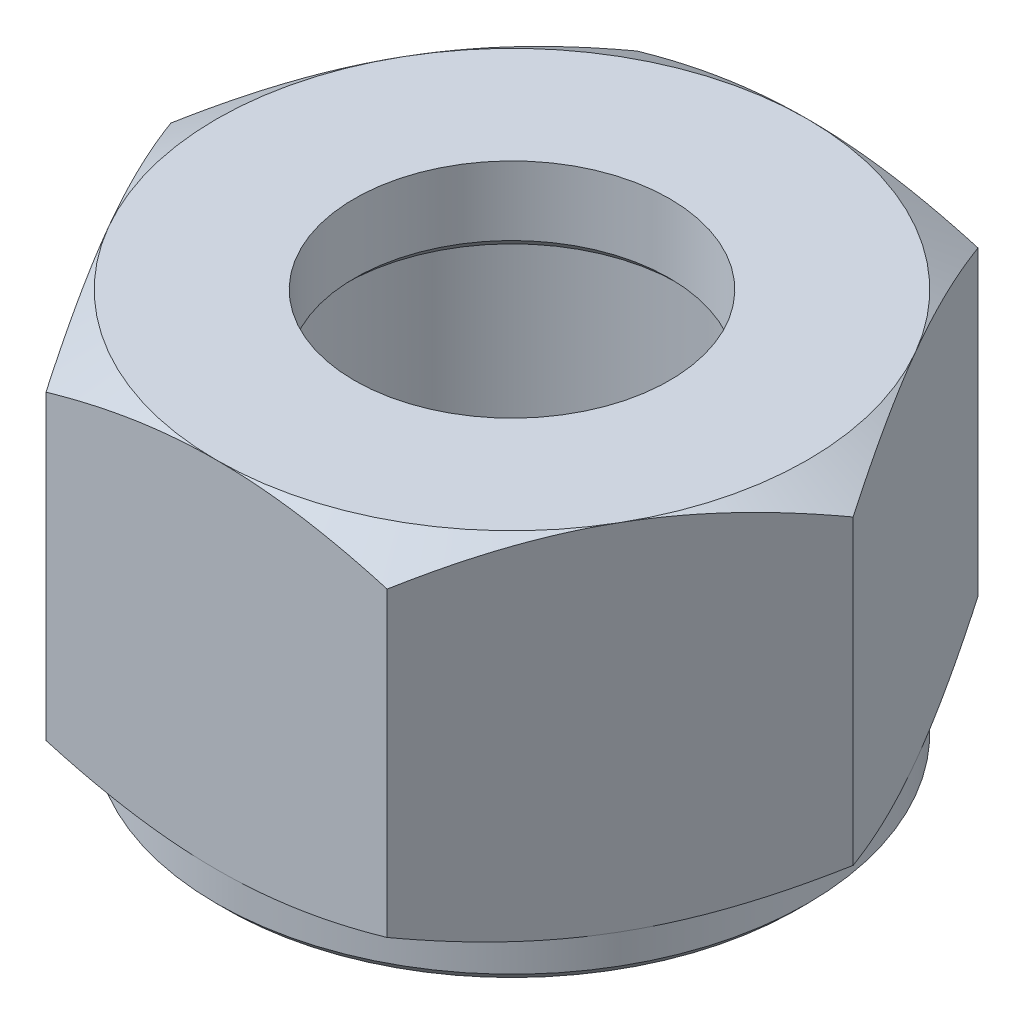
ISO-10303-21;
HEADER;
FILE_DESCRIPTION(('STEP AP214'),'2;1');
FILE_NAME('part.step','',(''),(''),'','','');
FILE_SCHEMA(('AUTOMOTIVE_DESIGN { 1 0 10303 214 1 1 1 1 }'));
ENDSEC;
DATA;
#1=APPLICATION_CONTEXT('core data for automotive mechanical design processes');
#2=APPLICATION_PROTOCOL_DEFINITION('international standard','automotive_design',2000,#1);
#3=PRODUCT_CONTEXT('',#1,'mechanical');
#4=PRODUCT('Part','Part','',(#3));
#5=PRODUCT_RELATED_PRODUCT_CATEGORY('part','',(#4));
#6=PRODUCT_DEFINITION_FORMATION('','',#4);
#7=PRODUCT_DEFINITION_CONTEXT('part definition',#1,'design');
#8=PRODUCT_DEFINITION('design','',#6,#7);
#9=PRODUCT_DEFINITION_SHAPE('','',#8);
#10=(LENGTH_UNIT() NAMED_UNIT(*) SI_UNIT(.MILLI.,.METRE.));
#11=(NAMED_UNIT(*) PLANE_ANGLE_UNIT() SI_UNIT($,.RADIAN.));
#12=(NAMED_UNIT(*) SI_UNIT($,.STERADIAN.) SOLID_ANGLE_UNIT());
#13=UNCERTAINTY_MEASURE_WITH_UNIT(LENGTH_MEASURE(1.E-05),#10,'distance_accuracy_value','');
#14=(GEOMETRIC_REPRESENTATION_CONTEXT(3) GLOBAL_UNCERTAINTY_ASSIGNED_CONTEXT((#13)) GLOBAL_UNIT_ASSIGNED_CONTEXT((#10,
#11,#12)) REPRESENTATION_CONTEXT('',''));
#15=CARTESIAN_POINT('',(0.,0.,0.));
#16=DIRECTION('',(0.,0.,1.));
#17=DIRECTION('',(1.,0.,0.));
#18=AXIS2_PLACEMENT_3D('',#15,#16,#17);
#19=CARTESIAN_POINT('',(8.66025403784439,18.,15.));
#20=DIRECTION('',(-0.866025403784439,0.,-0.5));
#21=DIRECTION('',(-0.5,0.,0.866025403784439));
#22=AXIS2_PLACEMENT_3D('',#19,#20,#21);
#23=PLANE('',#22);
#24=CARTESIAN_POINT('',(17.3206235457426,1.33981262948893,-0.000200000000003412));
#25=CARTESIAN_POINT('',(17.130274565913,1.22992178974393,0.329494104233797));
#26=CARTESIAN_POINT('',(16.939183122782,1.1250175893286,0.660474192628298));
#27=CARTESIAN_POINT('',(16.5554679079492,0.926568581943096,1.32508844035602));
#28=CARTESIAN_POINT('',(16.3628436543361,0.833027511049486,1.6587234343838));
#29=CARTESIAN_POINT('',(15.9756905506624,0.658562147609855,2.32929228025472));
#30=CARTESIAN_POINT('',(15.7811583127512,0.577667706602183,2.66623200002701));
#31=CARTESIAN_POINT('',(15.3907420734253,0.430232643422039,3.34245276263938));
#32=CARTESIAN_POINT('',(15.1948581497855,0.363691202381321,3.68173367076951));
#33=CARTESIAN_POINT('',(14.8067578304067,0.247792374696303,4.35394314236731));
#34=CARTESIAN_POINT('',(14.6145702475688,0.19805138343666,4.68682180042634));
#35=CARTESIAN_POINT('',(14.2293144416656,0.114646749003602,5.35410443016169));
#36=CARTESIAN_POINT('',(14.0362462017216,0.0809834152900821,5.68850843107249));
#37=CARTESIAN_POINT('',(13.6497853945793,0.0305840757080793,6.35787818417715));
#38=CARTESIAN_POINT('',(13.4563934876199,0.0138279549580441,6.69284279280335));
#39=CARTESIAN_POINT('',(13.0694311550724,-0.00239660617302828,7.36308121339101));
#40=CARTESIAN_POINT('',(12.8758607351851,-0.00186558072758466,7.69835501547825));
#41=CARTESIAN_POINT('',(12.5139822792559,0.0152766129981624,8.32514688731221));
#42=CARTESIAN_POINT('',(12.3456484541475,0.0297968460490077,8.61670962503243));
#43=CARTESIAN_POINT('',(12.0093680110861,0.0716371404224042,9.19916443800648));
#44=CARTESIAN_POINT('',(11.8414214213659,0.0989581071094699,9.49005646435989));
#45=CARTESIAN_POINT('',(11.5060066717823,0.165923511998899,10.0710118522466));
#46=CARTESIAN_POINT('',(11.338539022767,0.205578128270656,10.3610743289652));
#47=CARTESIAN_POINT('',(11.0043888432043,0.296515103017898,10.939839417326));
#48=CARTESIAN_POINT('',(10.8377063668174,0.347798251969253,11.2285419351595));
#49=CARTESIAN_POINT('',(10.3317324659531,0.520386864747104,12.1049144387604));
#50=CARTESIAN_POINT('',(9.99390625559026,0.658901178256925,12.6900465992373));
#51=CARTESIAN_POINT('',(9.32329122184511,0.973271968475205,13.8515859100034));
#52=CARTESIAN_POINT('',(8.99049381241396,1.14905461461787,14.4280079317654));
#53=CARTESIAN_POINT('',(8.66013856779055,1.33981262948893,15.0002));
#54=B_SPLINE_CURVE_WITH_KNOTS('',3,(#24,#25,#26,#27,#28,#29,#30,#31,#32,#33,#34,#35,#36,#37,#38,
#39,#40,#41,#42,#43,#44,#45,#46,#47,#48,#49,#50,#51,#52,#53),.UNSPECIFIED.,.F.,.F.,(4,2,2,2,2,2,
2,2,2,2,2,2,2,2,4),(0.,1.18875411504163,2.37789802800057,3.56980778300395,4.76164951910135,
5.92407379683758,7.08652044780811,8.24758247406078,9.40860862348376,10.4193068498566,
11.4300765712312,12.4416826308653,13.4533574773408,15.5211962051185,17.5849760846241),.UNSPECIFIED.);
#55=CARTESIAN_POINT('',(17.3205080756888,1.3397459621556,0.));
#56=VERTEX_POINT('',#55);
#57=CARTESIAN_POINT('',(12.9903810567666,0.,7.50000000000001));
#58=VERTEX_POINT('',#57);
#59=EDGE_CURVE('E573',#56,#58,#54,.T.);
#60=ORIENTED_EDGE('',*,*,#59,.F.);
#61=DIRECTION('',(0.,-1.,0.));
#62=VECTOR('',#61,1.);
#63=CARTESIAN_POINT('',(17.3205080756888,18.,0.));
#64=LINE('',#63,#62);
#65=CARTESIAN_POINT('',(17.3205080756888,16.6602540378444,0.));
#66=VERTEX_POINT('',#65);
#67=EDGE_CURVE('E535',#66,#56,#64,.T.);
#68=ORIENTED_EDGE('',*,*,#67,.F.);
#69=CARTESIAN_POINT('',(8.66013856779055,16.6601873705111,15.0002));
#70=CARTESIAN_POINT('',(8.85048754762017,16.7700782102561,14.6705058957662));
#71=CARTESIAN_POINT('',(9.04157899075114,16.8749824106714,14.3395258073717));
#72=CARTESIAN_POINT('',(9.425294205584,17.0734314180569,13.674911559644));
#73=CARTESIAN_POINT('',(9.61791845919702,17.1669724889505,13.3412765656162));
#74=CARTESIAN_POINT('',(10.0050715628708,17.3414378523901,12.6707077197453));
#75=CARTESIAN_POINT('',(10.199603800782,17.4223322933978,12.333767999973));
#76=CARTESIAN_POINT('',(10.5900200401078,17.569767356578,11.6575472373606));
#77=CARTESIAN_POINT('',(10.7859039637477,17.6363087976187,11.3182663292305));
#78=CARTESIAN_POINT('',(11.1740042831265,17.7522076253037,10.6460568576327));
#79=CARTESIAN_POINT('',(11.3661918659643,17.8019486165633,10.3131781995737));
#80=CARTESIAN_POINT('',(11.7514476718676,17.8853532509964,9.64589556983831));
#81=CARTESIAN_POINT('',(11.9445159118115,17.9190165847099,9.31149156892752));
#82=CARTESIAN_POINT('',(12.3309767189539,17.9694159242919,8.64212181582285));
#83=CARTESIAN_POINT('',(12.5243686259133,17.9861720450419,8.30715720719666));
#84=CARTESIAN_POINT('',(12.9113309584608,18.002396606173,7.636918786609));
#85=CARTESIAN_POINT('',(13.1049013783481,18.0018655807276,7.30164498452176));
#86=CARTESIAN_POINT('',(13.4667798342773,17.9847233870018,6.6748531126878));
#87=CARTESIAN_POINT('',(13.6351136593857,17.970203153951,6.38329037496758));
#88=CARTESIAN_POINT('',(13.9713941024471,17.9283628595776,5.80083556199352));
#89=CARTESIAN_POINT('',(14.1393406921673,17.9010418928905,5.50994353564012));
#90=CARTESIAN_POINT('',(14.4747554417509,17.8340764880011,4.92898814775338));
#91=CARTESIAN_POINT('',(14.6422230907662,17.7944218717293,4.63892567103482));
#92=CARTESIAN_POINT('',(14.9763732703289,17.7034848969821,4.06016058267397));
#93=CARTESIAN_POINT('',(15.1430557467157,17.6522017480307,3.77145806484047));
#94=CARTESIAN_POINT('',(15.6490296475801,17.4796131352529,2.89508556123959));
#95=CARTESIAN_POINT('',(15.9868558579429,17.3410988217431,2.30995340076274));
#96=CARTESIAN_POINT('',(16.6574708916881,17.0267280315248,1.14841408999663));
#97=CARTESIAN_POINT('',(16.9902683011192,16.8509453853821,0.571992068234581));
#98=CARTESIAN_POINT('',(17.3206235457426,16.6601873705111,-0.000200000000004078));
#99=B_SPLINE_CURVE_WITH_KNOTS('',3,(#69,#70,#71,#72,#73,#74,#75,#76,#77,#78,#79,#80,#81,#82,#83,
#84,#85,#86,#87,#88,#89,#90,#91,#92,#93,#94,#95,#96,#97,#98),.UNSPECIFIED.,.F.,.F.,(4,2,2,2,2,2,
2,2,2,2,2,2,2,2,4),(0.,1.18875411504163,2.37789802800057,3.56980778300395,4.76164951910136,
5.92407379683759,7.08652044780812,8.24758247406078,9.40860862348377,10.4193068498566,
11.4300765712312,12.4416826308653,13.4533574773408,15.5211962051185,17.5849760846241),.UNSPECIFIED.);
#100=CARTESIAN_POINT('',(12.9903810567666,18.,7.5));
#101=VERTEX_POINT('',#100);
#102=EDGE_CURVE('E250',#101,#66,#99,.T.);
#103=ORIENTED_EDGE('',*,*,#102,.F.);
#104=CARTESIAN_POINT('',(8.66025403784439,16.6602540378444,15.));
#105=VERTEX_POINT('',#104);
#106=EDGE_CURVE('E532',#105,#101,#99,.T.);
#107=ORIENTED_EDGE('',*,*,#106,.F.);
#108=DIRECTION('',(0.,-1.,0.));
#109=VECTOR('',#108,1.);
#110=CARTESIAN_POINT('',(8.66025403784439,18.,15.));
#111=LINE('',#110,#109);
#112=CARTESIAN_POINT('',(8.66025403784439,1.3397459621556,15.));
#113=VERTEX_POINT('',#112);
#114=EDGE_CURVE('E537',#105,#113,#111,.T.);
#115=ORIENTED_EDGE('',*,*,#114,.T.);
#116=EDGE_CURVE('E209',#58,#113,#54,.T.);
#117=ORIENTED_EDGE('',*,*,#116,.F.);
#118=EDGE_LOOP('',(#60,#68,#103,#107,#115,#117));
#119=FACE_BOUND('',#118,.T.);
#120=ADVANCED_FACE('F41',(#119),#23,.F.);
#121=CARTESIAN_POINT('',(17.3205080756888,18.,0.));
#122=DIRECTION('',(-0.866025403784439,0.,0.5));
#123=DIRECTION('',(0.5,0.,0.866025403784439));
#124=AXIS2_PLACEMENT_3D('',#121,#122,#123);
#125=PLANE('',#124);
#126=CARTESIAN_POINT('',(8.66013856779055,1.33981262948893,-15.0002));
#127=CARTESIAN_POINT('',(8.85048754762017,1.22992178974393,-14.6705058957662));
#128=CARTESIAN_POINT('',(9.04157899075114,1.12501758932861,-14.3395258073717));
#129=CARTESIAN_POINT('',(9.425294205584,0.9265685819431,-13.674911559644));
#130=CARTESIAN_POINT('',(9.61791845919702,0.833027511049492,-13.3412765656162));
#131=CARTESIAN_POINT('',(10.0050715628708,0.658562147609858,-12.6707077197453));
#132=CARTESIAN_POINT('',(10.199603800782,0.577667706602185,-12.333767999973));
#133=CARTESIAN_POINT('',(10.5900200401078,0.43023264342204,-11.6575472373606));
#134=CARTESIAN_POINT('',(10.7859039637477,0.363691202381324,-11.3182663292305));
#135=CARTESIAN_POINT('',(11.1740042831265,0.247792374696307,-10.6460568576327));
#136=CARTESIAN_POINT('',(11.3661918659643,0.198051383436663,-10.3131781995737));
#137=CARTESIAN_POINT('',(11.7514476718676,0.114646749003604,-9.64589556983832));
#138=CARTESIAN_POINT('',(11.9445159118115,0.0809834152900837,-9.31149156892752));
#139=CARTESIAN_POINT('',(12.3309767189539,0.0305840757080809,-8.64212181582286));
#140=CARTESIAN_POINT('',(12.5243686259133,0.0138279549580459,-8.30715720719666));
#141=CARTESIAN_POINT('',(12.9113309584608,-0.00239660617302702,-7.63691878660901));
#142=CARTESIAN_POINT('',(13.1049013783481,-0.00186558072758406,-7.30164498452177));
#143=CARTESIAN_POINT('',(13.4667798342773,0.0152766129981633,-6.67485311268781));
#144=CARTESIAN_POINT('',(13.6351136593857,0.0297968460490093,-6.38329037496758));
#145=CARTESIAN_POINT('',(13.9713941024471,0.0716371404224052,-5.80083556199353));
#146=CARTESIAN_POINT('',(14.1393406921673,0.0989581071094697,-5.50994353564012));
#147=CARTESIAN_POINT('',(14.4747554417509,0.165923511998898,-4.92898814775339));
#148=CARTESIAN_POINT('',(14.6422230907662,0.205578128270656,-4.63892567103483));
#149=CARTESIAN_POINT('',(14.9763732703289,0.296515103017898,-4.06016058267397));
#150=CARTESIAN_POINT('',(15.1430557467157,0.347798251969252,-3.77145806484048));
#151=CARTESIAN_POINT('',(15.6490296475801,0.5203868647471,-2.8950855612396));
#152=CARTESIAN_POINT('',(15.9868558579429,0.658901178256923,-2.30995340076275));
#153=CARTESIAN_POINT('',(16.6574708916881,0.973271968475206,-1.14841408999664));
#154=CARTESIAN_POINT('',(16.9902683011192,1.14905461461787,-0.571992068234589));
#155=CARTESIAN_POINT('',(17.3206235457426,1.33981262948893,0.000199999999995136));
#156=B_SPLINE_CURVE_WITH_KNOTS('',3,(#126,#127,#128,#129,#130,#131,#132,#133,#134,#135,#136,
#137,#138,#139,#140,#141,#142,#143,#144,#145,#146,#147,#148,#149,#150,#151,#152,#153,#154,#155),
.UNSPECIFIED.,.F.,.F.,(4,2,2,2,2,2,2,2,2,2,2,2,2,2,4),(0.,1.18875411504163,2.37789802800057,
3.56980778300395,4.76164951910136,5.92407379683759,7.08652044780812,8.24758247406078,
9.40860862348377,10.4193068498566,11.4300765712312,12.4416826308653,13.4533574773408,
15.5211962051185,17.5849760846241),.UNSPECIFIED.);
#157=CARTESIAN_POINT('',(8.66025403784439,1.33974596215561,-15.));
#158=VERTEX_POINT('',#157);
#159=CARTESIAN_POINT('',(12.9903810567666,0.,-7.5));
#160=VERTEX_POINT('',#159);
#161=EDGE_CURVE('E156',#158,#160,#156,.T.);
#162=ORIENTED_EDGE('',*,*,#161,.F.);
#163=DIRECTION('',(0.,-1.,0.));
#164=VECTOR('',#163,1.);
#165=CARTESIAN_POINT('',(8.66025403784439,18.,-15.));
#166=LINE('',#165,#164);
#167=CARTESIAN_POINT('',(8.66025403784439,16.6602540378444,-15.));
#168=VERTEX_POINT('',#167);
#169=EDGE_CURVE('E164',#168,#158,#166,.T.);
#170=ORIENTED_EDGE('',*,*,#169,.F.);
#171=CARTESIAN_POINT('',(17.3206235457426,16.6601873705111,0.000199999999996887));
#172=CARTESIAN_POINT('',(17.130274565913,16.7700782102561,-0.329494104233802));
#173=CARTESIAN_POINT('',(16.939183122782,16.8749824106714,-0.660474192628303));
#174=CARTESIAN_POINT('',(16.5554679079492,17.0734314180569,-1.32508844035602));
#175=CARTESIAN_POINT('',(16.3628436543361,17.1669724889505,-1.65872343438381));
#176=CARTESIAN_POINT('',(15.9756905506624,17.3414378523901,-2.32929228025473));
#177=CARTESIAN_POINT('',(15.7811583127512,17.4223322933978,-2.66623200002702));
#178=CARTESIAN_POINT('',(15.3907420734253,17.569767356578,-3.34245276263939));
#179=CARTESIAN_POINT('',(15.1948581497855,17.6363087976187,-3.68173367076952));
#180=CARTESIAN_POINT('',(14.8067578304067,17.7522076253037,-4.35394314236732));
#181=CARTESIAN_POINT('',(14.6145702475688,17.8019486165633,-4.68682180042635));
#182=CARTESIAN_POINT('',(14.2293144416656,17.8853532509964,-5.3541044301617));
#183=CARTESIAN_POINT('',(14.0362462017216,17.9190165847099,-5.6885084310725));
#184=CARTESIAN_POINT('',(13.6497853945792,17.9694159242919,-6.35787818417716));
#185=CARTESIAN_POINT('',(13.4563934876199,17.9861720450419,-6.69284279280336));
#186=CARTESIAN_POINT('',(13.0694311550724,18.002396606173,-7.36308121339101));
#187=CARTESIAN_POINT('',(12.8758607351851,18.0018655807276,-7.69835501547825));
#188=CARTESIAN_POINT('',(12.5139822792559,17.9847233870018,-8.32514688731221));
#189=CARTESIAN_POINT('',(12.3456484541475,17.970203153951,-8.61670962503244));
#190=CARTESIAN_POINT('',(12.0093680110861,17.9283628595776,-9.19916443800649));
#191=CARTESIAN_POINT('',(11.8414214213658,17.9010418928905,-9.4900564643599));
#192=CARTESIAN_POINT('',(11.5060066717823,17.8340764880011,-10.0710118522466));
#193=CARTESIAN_POINT('',(11.338539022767,17.7944218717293,-10.3610743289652));
#194=CARTESIAN_POINT('',(11.0043888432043,17.7034848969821,-10.9398394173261));
#195=CARTESIAN_POINT('',(10.8377063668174,17.6522017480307,-11.2285419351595));
#196=CARTESIAN_POINT('',(10.3317324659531,17.4796131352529,-12.1049144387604));
#197=CARTESIAN_POINT('',(9.99390625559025,17.3410988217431,-12.6900465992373));
#198=CARTESIAN_POINT('',(9.3232912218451,17.0267280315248,-13.8515859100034));
#199=CARTESIAN_POINT('',(8.99049381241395,16.8509453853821,-14.4280079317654));
#200=CARTESIAN_POINT('',(8.66013856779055,16.6601873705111,-15.0002));
#201=B_SPLINE_CURVE_WITH_KNOTS('',3,(#171,#172,#173,#174,#175,#176,#177,#178,#179,#180,#181,
#182,#183,#184,#185,#186,#187,#188,#189,#190,#191,#192,#193,#194,#195,#196,#197,#198,#199,#200),
.UNSPECIFIED.,.F.,.F.,(4,2,2,2,2,2,2,2,2,2,2,2,2,2,4),(0.,1.18875411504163,2.37789802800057,
3.56980778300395,4.76164951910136,5.92407379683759,7.08652044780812,8.24758247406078,
9.40860862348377,10.4193068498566,11.4300765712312,12.4416826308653,13.4533574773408,
15.5211962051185,17.5849760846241),.UNSPECIFIED.);
#202=CARTESIAN_POINT('',(12.9903810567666,18.,-7.5));
#203=VERTEX_POINT('',#202);
#204=EDGE_CURVE('E244',#203,#168,#201,.T.);
#205=ORIENTED_EDGE('',*,*,#204,.F.);
#206=EDGE_CURVE('E249',#66,#203,#201,.T.);
#207=ORIENTED_EDGE('',*,*,#206,.F.);
#208=ORIENTED_EDGE('',*,*,#67,.T.);
#209=EDGE_CURVE('E174',#160,#56,#156,.T.);
#210=ORIENTED_EDGE('',*,*,#209,.F.);
#211=EDGE_LOOP('',(#162,#170,#205,#207,#208,#210));
#212=FACE_BOUND('',#211,.T.);
#213=ADVANCED_FACE('F255',(#212),#125,.F.);
#214=CARTESIAN_POINT('',(8.66025403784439,18.,-15.));
#215=DIRECTION('',(0.,0.,1.));
#216=DIRECTION('',(1.,0.,0.));
#217=AXIS2_PLACEMENT_3D('',#214,#215,#216);
#218=PLANE('',#217);
#219=CARTESIAN_POINT('',(-23.3393940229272,7.35772870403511,-15.));
#220=CARTESIAN_POINT('',(-23.0114053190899,7.1984305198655,-15.));
#221=CARTESIAN_POINT('',(-22.6830336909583,7.03992113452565,-15.));
#222=CARTESIAN_POINT('',(-22.0254446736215,6.72465852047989,-15.));
#223=CARTESIAN_POINT('',(-21.6962272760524,6.56790530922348,-15.));
#224=CARTESIAN_POINT('',(-20.7070998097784,6.10050689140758,-15.));
#225=CARTESIAN_POINT('',(-20.0458104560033,5.79276964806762,-15.));
#226=CARTESIAN_POINT('',(-18.7152703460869,5.18525804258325,-15.));
#227=CARTESIAN_POINT('',(-18.0459958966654,4.88553544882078,-15.));
#228=CARTESIAN_POINT('',(-16.7021489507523,4.29825531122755,-15.));
#229=CARTESIAN_POINT('',(-16.0275767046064,4.01069719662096,-15.));
#230=CARTESIAN_POINT('',(-14.65041648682,3.44202642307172,-15.));
#231=CARTESIAN_POINT('',(-13.9476215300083,3.16141243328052,-15.));
#232=CARTESIAN_POINT('',(-12.5338342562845,2.62123584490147,-15.));
#233=CARTESIAN_POINT('',(-11.8228410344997,2.36167559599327,-15.));
#234=CARTESIAN_POINT('',(-10.3928529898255,1.87036497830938,-15.));
#235=CARTESIAN_POINT('',(-9.67387739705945,1.63855908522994,-15.));
#236=CARTESIAN_POINT('',(-8.22554789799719,1.21012903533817,-15.));
#237=CARTESIAN_POINT('',(-7.49619731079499,1.01349388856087,-15.));
#238=CARTESIAN_POINT('',(-6.39616851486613,0.752505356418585,-15.));
#239=CARTESIAN_POINT('',(-6.02945591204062,0.671337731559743,-15.));
#240=CARTESIAN_POINT('',(-5.29351072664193,0.521298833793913,-15.));
#241=CARTESIAN_POINT('',(-4.92427819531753,0.452427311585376,-15.));
#242=CARTESIAN_POINT('',(-4.1835438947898,0.328191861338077,-15.));
#243=CARTESIAN_POINT('',(-3.81204217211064,0.272827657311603,-15.));
#244=CARTESIAN_POINT('',(-3.06715672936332,0.176708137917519,-15.));
#245=CARTESIAN_POINT('',(-2.69377309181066,0.135952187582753,-15.));
#246=CARTESIAN_POINT('',(-1.95055361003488,0.0703738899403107,-15.));
#247=CARTESIAN_POINT('',(-1.58073575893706,0.045348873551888,-15.));
#248=CARTESIAN_POINT('',(-0.840373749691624,0.0109645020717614,-15.));
#249=CARTESIAN_POINT('',(-0.469829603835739,0.00160488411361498,-15.));
#250=CARTESIAN_POINT('',(0.271329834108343,-0.00122574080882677,-15.));
#251=CARTESIAN_POINT('',(0.641945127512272,0.00530358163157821,-15.));
#252=CARTESIAN_POINT('',(1.38256736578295,0.034090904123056,-15.));
#253=CARTESIAN_POINT('',(1.75257428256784,0.0563496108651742,-15.));
#254=CARTESIAN_POINT('',(2.63914919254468,0.128055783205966,-15.));
#255=CARTESIAN_POINT('',(3.15513827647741,0.184817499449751,-15.));
#256=CARTESIAN_POINT('',(4.18331580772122,0.325854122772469,-15.));
#257=CARTESIAN_POINT('',(4.6955037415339,0.410132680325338,-15.));
#258=CARTESIAN_POINT('',(6.22573209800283,0.699775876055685,-15.));
#259=CARTESIAN_POINT('',(7.23690824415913,0.941899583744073,-15.));
#260=CARTESIAN_POINT('',(8.7496746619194,1.36230448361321,-15.));
#261=CARTESIAN_POINT('',(9.25908594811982,1.51406195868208,-15.));
#262=CARTESIAN_POINT('',(10.2729574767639,1.83344648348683,-15.));
#263=CARTESIAN_POINT('',(10.7774176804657,2.00107365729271,-15.));
#264=CARTESIAN_POINT('',(11.7815583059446,2.34950036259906,-15.));
#265=CARTESIAN_POINT('',(12.2812401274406,2.53029589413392,-15.));
#266=CARTESIAN_POINT('',(13.0276432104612,2.80976049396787,-15.));
#267=CARTESIAN_POINT('',(13.2759225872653,2.90429322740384,-15.));
#268=CARTESIAN_POINT('',(13.7715052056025,3.09588586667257,-15.));
#269=CARTESIAN_POINT('',(14.0188084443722,3.19294577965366,-15.));
#270=CARTESIAN_POINT('',(14.7100541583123,3.46797636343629,-15.));
#271=CARTESIAN_POINT('',(15.1529688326,3.64853296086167,-15.));
#272=CARTESIAN_POINT('',(16.0361480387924,4.01602791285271,-15.));
#273=CARTESIAN_POINT('',(16.4764125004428,4.20296643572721,-15.));
#274=CARTESIAN_POINT('',(17.3546172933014,4.58232673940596,-15.));
#275=CARTESIAN_POINT('',(17.7925574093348,4.7747490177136,-15.));
#276=CARTESIAN_POINT('',(18.6663393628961,5.1643048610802,-15.));
#277=CARTESIAN_POINT('',(19.1021811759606,5.36143848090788,-15.));
#278=CARTESIAN_POINT('',(20.4072632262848,5.95907943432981,-15.));
#279=CARTESIAN_POINT('',(21.2737159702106,6.36567698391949,-15.));
#280=CARTESIAN_POINT('',(23.0006921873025,7.19111629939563,-15.));
#281=CARTESIAN_POINT('',(23.8612159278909,7.60995750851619,-15.));
#282=CARTESIAN_POINT('',(25.579007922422,8.45783443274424,-15.));
#283=CARTESIAN_POINT('',(26.4362683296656,8.88688601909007,-15.));
#284=CARTESIAN_POINT('',(28.1470099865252,9.75246441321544,-15.));
#285=CARTESIAN_POINT('',(29.0004912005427,10.1889912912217,-15.));
#286=CARTESIAN_POINT('',(30.7041763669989,11.067900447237,-15.));
#287=CARTESIAN_POINT('',(31.5543810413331,11.510281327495,-15.));
#288=CARTESIAN_POINT('',(33.2522578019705,12.3998643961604,-15.));
#289=CARTESIAN_POINT('',(34.0999298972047,12.8470665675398,-15.));
#290=CARTESIAN_POINT('',(36.4510001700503,14.0943921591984,-15.));
#291=CARTESIAN_POINT('',(37.9521489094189,14.8987545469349,-15.));
#292=CARTESIAN_POINT('',(40.9497293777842,16.5164409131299,-15.));
#293=CARTESIAN_POINT('',(42.4461607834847,17.3297654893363,-15.));
#294=CARTESIAN_POINT('',(45.4303198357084,18.9602846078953,-15.));
#295=CARTESIAN_POINT('',(46.9180597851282,19.7774566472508,-15.));
#296=CARTESIAN_POINT('',(49.1475221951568,21.006960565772,-15.));
#297=CARTESIAN_POINT('',(49.8902881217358,21.4174026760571,-15.));
#298=CARTESIAN_POINT('',(51.375200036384,22.2394049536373,-15.));
#299=CARTESIAN_POINT('',(52.1173460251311,22.6509651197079,-15.));
#300=CARTESIAN_POINT('',(52.8592206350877,23.0630140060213,-15.));
#301=B_SPLINE_CURVE_WITH_KNOTS('',3,(#219,#220,#221,#222,#223,#224,#225,#226,#227,#228,#229,
#230,#231,#232,#233,#234,#235,#236,#237,#238,#239,#240,#241,#242,#243,#244,#245,#246,#247,#248,
#249,#250,#251,#252,#253,#254,#255,#256,#257,#258,#259,#260,#261,#262,#263,#264,#265,#266,#267,
#268,#269,#270,#271,#272,#273,#274,#275,#276,#277,#278,#279,#280,#281,#282,#283,#284,#285,#286,
#287,#288,#289,#290,#291,#292,#293,#294,#295,#296,#297,#298,#299,#300),.UNSPECIFIED.,.F.,.F.,(4,
2,2,2,2,2,2,2,2,2,2,2,2,2,2,2,2,2,2,2,2,2,2,2,2,2,2,2,2,2,2,2,2,2,2,2,2,2,2,2,4),(0.,
1.09387761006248,2.18776607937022,4.37586329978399,6.57573652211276,8.77550640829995,
11.0454877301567,13.3157220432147,15.5813359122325,17.8462405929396,18.9728316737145,
20.0993999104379,21.225945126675,22.3524413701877,23.4641097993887,24.5757595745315,
25.6874323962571,26.7991551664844,28.3555836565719,29.912218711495,33.0270748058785,
34.6215460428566,36.2160297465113,37.8100311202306,38.6070207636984,39.404012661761,
40.8388587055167,42.2737426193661,43.708757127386,45.1437883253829,48.0149765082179,
50.8860343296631,53.7618915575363,56.6377758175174,59.5129853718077,62.3881847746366,
67.4973462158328,72.6068505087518,77.6990134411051,80.2448869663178,82.7907577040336),.UNSPECIFIED.);
#302=CARTESIAN_POINT('',(-8.6602540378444,1.33974596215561,-15.));
#303=VERTEX_POINT('',#302);
#304=CARTESIAN_POINT('',(0.,0.,-15.));
#305=VERTEX_POINT('',#304);
#306=EDGE_CURVE('E143',#303,#305,#301,.T.);
#307=ORIENTED_EDGE('',*,*,#306,.F.);
#308=DIRECTION('',(0.,-1.,0.));
#309=VECTOR('',#308,1.);
#310=CARTESIAN_POINT('',(-8.6602540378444,18.,-15.));
#311=LINE('',#310,#309);
#312=CARTESIAN_POINT('',(-8.6602540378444,16.6602540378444,-15.));
#313=VERTEX_POINT('',#312);
#314=EDGE_CURVE('E548',#313,#303,#311,.T.);
#315=ORIENTED_EDGE('',*,*,#314,.F.);
#316=CARTESIAN_POINT('',(-23.3393940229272,10.6422712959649,-15.));
#317=CARTESIAN_POINT('',(-23.0114053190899,10.8015694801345,-15.));
#318=CARTESIAN_POINT('',(-22.6830336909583,10.9600788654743,-15.));
#319=CARTESIAN_POINT('',(-22.0254446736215,11.2753414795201,-15.));
#320=CARTESIAN_POINT('',(-21.6962272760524,11.4320946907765,-15.));
#321=CARTESIAN_POINT('',(-20.7070998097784,11.8994931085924,-15.));
#322=CARTESIAN_POINT('',(-20.0458104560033,12.2072303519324,-15.));
#323=CARTESIAN_POINT('',(-18.7152703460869,12.8147419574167,-15.));
#324=CARTESIAN_POINT('',(-18.0459958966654,13.1144645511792,-15.));
#325=CARTESIAN_POINT('',(-16.7021489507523,13.7017446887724,-15.));
#326=CARTESIAN_POINT('',(-16.0275767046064,13.989302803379,-15.));
#327=CARTESIAN_POINT('',(-14.65041648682,14.5579735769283,-15.));
#328=CARTESIAN_POINT('',(-13.9476215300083,14.8385875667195,-15.));
#329=CARTESIAN_POINT('',(-12.5338342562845,15.3787641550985,-15.));
#330=CARTESIAN_POINT('',(-11.8228410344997,15.6383244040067,-15.));
#331=CARTESIAN_POINT('',(-10.3928529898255,16.1296350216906,-15.));
#332=CARTESIAN_POINT('',(-9.67387739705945,16.3614409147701,-15.));
#333=CARTESIAN_POINT('',(-8.22554789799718,16.7898709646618,-15.));
#334=CARTESIAN_POINT('',(-7.49619731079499,16.9865061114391,-15.));
#335=CARTESIAN_POINT('',(-6.39616851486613,17.2474946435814,-15.));
#336=CARTESIAN_POINT('',(-6.02945591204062,17.3286622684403,-15.));
#337=CARTESIAN_POINT('',(-5.29351072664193,17.4787011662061,-15.));
#338=CARTESIAN_POINT('',(-4.92427819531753,17.5475726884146,-15.));
#339=CARTESIAN_POINT('',(-4.1835438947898,17.6718081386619,-15.));
#340=CARTESIAN_POINT('',(-3.81204217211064,17.7271723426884,-15.));
#341=CARTESIAN_POINT('',(-3.06715672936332,17.8232918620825,-15.));
#342=CARTESIAN_POINT('',(-2.69377309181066,17.8640478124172,-15.));
#343=CARTESIAN_POINT('',(-1.95055361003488,17.9296261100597,-15.));
#344=CARTESIAN_POINT('',(-1.58073575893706,17.9546511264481,-15.));
#345=CARTESIAN_POINT('',(-0.840373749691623,17.9890354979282,-15.));
#346=CARTESIAN_POINT('',(-0.469829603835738,17.9983951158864,-15.));
#347=CARTESIAN_POINT('',(0.271329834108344,18.0012257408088,-15.));
#348=CARTESIAN_POINT('',(0.641945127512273,17.9946964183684,-15.));
#349=CARTESIAN_POINT('',(1.38256736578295,17.9659090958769,-15.));
#350=CARTESIAN_POINT('',(1.75257428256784,17.9436503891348,-15.));
#351=CARTESIAN_POINT('',(2.63914919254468,17.871944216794,-15.));
#352=CARTESIAN_POINT('',(3.15513827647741,17.8151825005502,-15.));
#353=CARTESIAN_POINT('',(4.18331580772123,17.6741458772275,-15.));
#354=CARTESIAN_POINT('',(4.6955037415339,17.5898673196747,-15.));
#355=CARTESIAN_POINT('',(6.22573209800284,17.3002241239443,-15.));
#356=CARTESIAN_POINT('',(7.23690824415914,17.0581004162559,-15.));
#357=CARTESIAN_POINT('',(8.7496746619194,16.6376955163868,-15.));
#358=CARTESIAN_POINT('',(9.25908594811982,16.4859380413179,-15.));
#359=CARTESIAN_POINT('',(10.2729574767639,16.1665535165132,-15.));
#360=CARTESIAN_POINT('',(10.7774176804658,15.9989263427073,-15.));
#361=CARTESIAN_POINT('',(11.7815583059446,15.6504996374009,-15.));
#362=CARTESIAN_POINT('',(12.2812401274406,15.4697041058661,-15.));
#363=CARTESIAN_POINT('',(13.0276432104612,15.1902395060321,-15.));
#364=CARTESIAN_POINT('',(13.2759225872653,15.0957067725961,-15.));
#365=CARTESIAN_POINT('',(13.7715052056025,14.9041141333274,-15.));
#366=CARTESIAN_POINT('',(14.0188084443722,14.8070542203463,-15.));
#367=CARTESIAN_POINT('',(14.7100541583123,14.5320236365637,-15.));
#368=CARTESIAN_POINT('',(15.1529688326,14.3514670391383,-15.));
#369=CARTESIAN_POINT('',(16.0361480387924,13.9839720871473,-15.));
#370=CARTESIAN_POINT('',(16.4764125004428,13.7970335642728,-15.));
#371=CARTESIAN_POINT('',(17.3546172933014,13.417673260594,-15.));
#372=CARTESIAN_POINT('',(17.7925574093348,13.2252509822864,-15.));
#373=CARTESIAN_POINT('',(18.6663393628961,12.8356951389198,-15.));
#374=CARTESIAN_POINT('',(19.1021811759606,12.6385615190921,-15.));
#375=CARTESIAN_POINT('',(20.4072632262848,12.0409205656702,-15.));
#376=CARTESIAN_POINT('',(21.2737159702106,11.6343230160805,-15.));
#377=CARTESIAN_POINT('',(23.0006921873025,10.8088837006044,-15.));
#378=CARTESIAN_POINT('',(23.8612159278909,10.3900424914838,-15.));
#379=CARTESIAN_POINT('',(25.579007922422,9.54216556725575,-15.));
#380=CARTESIAN_POINT('',(26.4362683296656,9.11311398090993,-15.));
#381=CARTESIAN_POINT('',(28.1470099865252,8.24753558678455,-15.));
#382=CARTESIAN_POINT('',(29.0004912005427,7.8110087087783,-15.));
#383=CARTESIAN_POINT('',(30.7041763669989,6.93209955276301,-15.));
#384=CARTESIAN_POINT('',(31.5543810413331,6.48971867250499,-15.));
#385=CARTESIAN_POINT('',(33.2522578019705,5.60013560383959,-15.));
#386=CARTESIAN_POINT('',(34.0999298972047,5.15293343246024,-15.));
#387=CARTESIAN_POINT('',(36.4510001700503,3.90560784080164,-15.));
#388=CARTESIAN_POINT('',(37.9521489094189,3.10124545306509,-15.));
#389=CARTESIAN_POINT('',(40.9497293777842,1.48355908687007,-15.));
#390=CARTESIAN_POINT('',(42.4461607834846,0.67023451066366,-15.));
#391=CARTESIAN_POINT('',(45.4303198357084,-0.960284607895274,-15.));
#392=CARTESIAN_POINT('',(46.9180597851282,-1.77745664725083,-15.));
#393=CARTESIAN_POINT('',(49.1475221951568,-3.00696056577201,-15.));
#394=CARTESIAN_POINT('',(49.8902881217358,-3.4174026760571,-15.));
#395=CARTESIAN_POINT('',(51.375200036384,-4.23940495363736,-15.));
#396=CARTESIAN_POINT('',(52.1173460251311,-4.65096511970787,-15.));
#397=CARTESIAN_POINT('',(52.8592206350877,-5.06301400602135,-15.));
#398=B_SPLINE_CURVE_WITH_KNOTS('',3,(#316,#317,#318,#319,#320,#321,#322,#323,#324,#325,#326,
#327,#328,#329,#330,#331,#332,#333,#334,#335,#336,#337,#338,#339,#340,#341,#342,#343,#344,#345,
#346,#347,#348,#349,#350,#351,#352,#353,#354,#355,#356,#357,#358,#359,#360,#361,#362,#363,#364,
#365,#366,#367,#368,#369,#370,#371,#372,#373,#374,#375,#376,#377,#378,#379,#380,#381,#382,#383,
#384,#385,#386,#387,#388,#389,#390,#391,#392,#393,#394,#395,#396,#397),.UNSPECIFIED.,.F.,.F.,(4,
2,2,2,2,2,2,2,2,2,2,2,2,2,2,2,2,2,2,2,2,2,2,2,2,2,2,2,2,2,2,2,2,2,2,2,2,2,2,2,4),(0.,
1.09387761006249,2.18776607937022,4.37586329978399,6.57573652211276,8.77550640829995,
11.0454877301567,13.3157220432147,15.5813359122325,17.8462405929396,18.9728316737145,
20.099399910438,21.2259451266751,22.3524413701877,23.4641097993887,24.5757595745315,
25.6874323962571,26.7991551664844,28.3555836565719,29.912218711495,33.0270748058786,
34.6215460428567,36.2160297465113,37.8100311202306,38.6070207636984,39.4040126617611,
40.8388587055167,42.2737426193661,43.708757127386,45.1437883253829,48.0149765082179,
50.8860343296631,53.7618915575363,56.6377758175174,59.5129853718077,62.3881847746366,
67.4973462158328,72.6068505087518,77.6990134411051,80.2448869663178,82.7907577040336),.UNSPECIFIED.);
#399=CARTESIAN_POINT('',(0.,18.,-15.));
#400=VERTEX_POINT('',#399);
#401=EDGE_CURVE('E238',#400,#313,#398,.F.);
#402=ORIENTED_EDGE('',*,*,#401,.F.);
#403=EDGE_CURVE('E243',#168,#400,#398,.F.);
#404=ORIENTED_EDGE('',*,*,#403,.F.);
#405=ORIENTED_EDGE('',*,*,#169,.T.);
#406=EDGE_CURVE('E151',#305,#158,#301,.T.);
#407=ORIENTED_EDGE('',*,*,#406,.F.);
#408=EDGE_LOOP('',(#307,#315,#402,#404,#405,#407));
#409=FACE_BOUND('',#408,.T.);
#410=ADVANCED_FACE('F161',(#409),#218,.F.);
#411=CARTESIAN_POINT('',(-8.6602540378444,18.,-15.));
#412=DIRECTION('',(0.866025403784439,0.,0.5));
#413=DIRECTION('',(0.5,0.,-0.866025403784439));
#414=AXIS2_PLACEMENT_3D('',#411,#412,#413);
#415=PLANE('',#414);
#416=CARTESIAN_POINT('',(-17.3206235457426,1.33981262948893,0.000200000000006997));
#417=CARTESIAN_POINT('',(-17.130274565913,1.22992178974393,-0.329494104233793));
#418=CARTESIAN_POINT('',(-16.939183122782,1.12501758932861,-0.660474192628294));
#419=CARTESIAN_POINT('',(-16.5554679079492,0.9265685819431,-1.32508844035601));
#420=CARTESIAN_POINT('',(-16.3628436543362,0.833027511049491,-1.6587234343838));
#421=CARTESIAN_POINT('',(-15.9756905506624,0.658562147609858,-2.32929228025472));
#422=CARTESIAN_POINT('',(-15.7811583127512,0.577667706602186,-2.66623200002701));
#423=CARTESIAN_POINT('',(-15.3907420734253,0.430232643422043,-3.34245276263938));
#424=CARTESIAN_POINT('',(-15.1948581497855,0.363691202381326,-3.68173367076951));
#425=CARTESIAN_POINT('',(-14.8067578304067,0.247792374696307,-4.35394314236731));
#426=CARTESIAN_POINT('',(-14.6145702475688,0.198051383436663,-4.68682180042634));
#427=CARTESIAN_POINT('',(-14.2293144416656,0.114646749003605,-5.35410443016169));
#428=CARTESIAN_POINT('',(-14.0362462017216,0.0809834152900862,-5.68850843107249));
#429=CARTESIAN_POINT('',(-13.6497853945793,0.0305840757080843,-6.35787818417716));
#430=CARTESIAN_POINT('',(-13.4563934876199,0.0138279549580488,-6.69284279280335));
#431=CARTESIAN_POINT('',(-13.0694311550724,-0.00239660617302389,-7.36308121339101));
#432=CARTESIAN_POINT('',(-12.8758607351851,-0.00186558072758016,-7.69835501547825));
#433=CARTESIAN_POINT('',(-12.5139822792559,0.0152766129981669,-8.32514688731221));
#434=CARTESIAN_POINT('',(-12.3456484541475,0.0297968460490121,-8.61670962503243));
#435=CARTESIAN_POINT('',(-12.0093680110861,0.071637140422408,-9.19916443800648));
#436=CARTESIAN_POINT('',(-11.8414214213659,0.0989581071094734,-9.49005646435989));
#437=CARTESIAN_POINT('',(-11.5060066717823,0.165923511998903,-10.0710118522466));
#438=CARTESIAN_POINT('',(-11.338539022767,0.205578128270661,-10.3610743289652));
#439=CARTESIAN_POINT('',(-11.0043888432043,0.296515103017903,-10.939839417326));
#440=CARTESIAN_POINT('',(-10.8377063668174,0.347798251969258,-11.2285419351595));
#441=CARTESIAN_POINT('',(-10.3317324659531,0.520386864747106,-12.1049144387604));
#442=CARTESIAN_POINT('',(-9.99390625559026,0.658901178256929,-12.6900465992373));
#443=CARTESIAN_POINT('',(-9.32329122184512,0.973271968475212,-13.8515859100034));
#444=CARTESIAN_POINT('',(-8.99049381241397,1.14905461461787,-14.4280079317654));
#445=CARTESIAN_POINT('',(-8.66013856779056,1.33981262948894,-15.0002));
#446=B_SPLINE_CURVE_WITH_KNOTS('',3,(#416,#417,#418,#419,#420,#421,#422,#423,#424,#425,#426,
#427,#428,#429,#430,#431,#432,#433,#434,#435,#436,#437,#438,#439,#440,#441,#442,#443,#444,#445),
.UNSPECIFIED.,.F.,.F.,(4,2,2,2,2,2,2,2,2,2,2,2,2,2,4),(0.,1.18875411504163,2.37789802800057,
3.56980778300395,4.76164951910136,5.92407379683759,7.08652044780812,8.24758247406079,
9.40860862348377,10.4193068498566,11.4300765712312,12.4416826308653,13.4533574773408,
15.5211962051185,17.5849760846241),.UNSPECIFIED.);
#447=CARTESIAN_POINT('',(-17.3205080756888,1.3397459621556,0.));
#448=VERTEX_POINT('',#447);
#449=CARTESIAN_POINT('',(-12.9903810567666,0.,-7.5));
#450=VERTEX_POINT('',#449);
#451=EDGE_CURVE('E166',#448,#450,#446,.T.);
#452=ORIENTED_EDGE('',*,*,#451,.F.);
#453=DIRECTION('',(0.,-1.,0.));
#454=VECTOR('',#453,1.);
#455=CARTESIAN_POINT('',(-17.3205080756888,18.,0.));
#456=LINE('',#455,#454);
#457=CARTESIAN_POINT('',(-17.3205080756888,16.6602540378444,0.));
#458=VERTEX_POINT('',#457);
#459=EDGE_CURVE('E550',#458,#448,#456,.T.);
#460=ORIENTED_EDGE('',*,*,#459,.F.);
#461=CARTESIAN_POINT('',(-8.66013856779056,16.6601873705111,-15.0002));
#462=CARTESIAN_POINT('',(-8.85048754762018,16.7700782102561,-14.6705058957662));
#463=CARTESIAN_POINT('',(-9.04157899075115,16.8749824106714,-14.3395258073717));
#464=CARTESIAN_POINT('',(-9.42529420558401,17.0734314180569,-13.674911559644));
#465=CARTESIAN_POINT('',(-9.61791845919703,17.1669724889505,-13.3412765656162));
#466=CARTESIAN_POINT('',(-10.0050715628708,17.3414378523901,-12.6707077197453));
#467=CARTESIAN_POINT('',(-10.199603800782,17.4223322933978,-12.333767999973));
#468=CARTESIAN_POINT('',(-10.5900200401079,17.569767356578,-11.6575472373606));
#469=CARTESIAN_POINT('',(-10.7859039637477,17.6363087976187,-11.3182663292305));
#470=CARTESIAN_POINT('',(-11.1740042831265,17.7522076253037,-10.6460568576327));
#471=CARTESIAN_POINT('',(-11.3661918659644,17.8019486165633,-10.3131781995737));
#472=CARTESIAN_POINT('',(-11.7514476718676,17.8853532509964,-9.64589556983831));
#473=CARTESIAN_POINT('',(-11.9445159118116,17.9190165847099,-9.31149156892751));
#474=CARTESIAN_POINT('',(-12.3309767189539,17.9694159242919,-8.64212181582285));
#475=CARTESIAN_POINT('',(-12.5243686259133,17.9861720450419,-8.30715720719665));
#476=CARTESIAN_POINT('',(-12.9113309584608,18.002396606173,-7.636918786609));
#477=CARTESIAN_POINT('',(-13.1049013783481,18.0018655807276,-7.30164498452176));
#478=CARTESIAN_POINT('',(-13.4667798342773,17.9847233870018,-6.6748531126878));
#479=CARTESIAN_POINT('',(-13.6351136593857,17.970203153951,-6.38329037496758));
#480=CARTESIAN_POINT('',(-13.9713941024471,17.9283628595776,-5.80083556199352));
#481=CARTESIAN_POINT('',(-14.1393406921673,17.9010418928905,-5.50994353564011));
#482=CARTESIAN_POINT('',(-14.4747554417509,17.8340764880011,-4.92898814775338));
#483=CARTESIAN_POINT('',(-14.6422230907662,17.7944218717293,-4.63892567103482));
#484=CARTESIAN_POINT('',(-14.9763732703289,17.7034848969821,-4.06016058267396));
#485=CARTESIAN_POINT('',(-15.1430557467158,17.6522017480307,-3.77145806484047));
#486=CARTESIAN_POINT('',(-15.6490296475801,17.4796131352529,-2.89508556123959));
#487=CARTESIAN_POINT('',(-15.9868558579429,17.3410988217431,-2.30995340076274));
#488=CARTESIAN_POINT('',(-16.6574708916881,17.0267280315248,-1.14841408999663));
#489=CARTESIAN_POINT('',(-16.9902683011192,16.8509453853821,-0.57199206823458));
#490=CARTESIAN_POINT('',(-17.3206235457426,16.6601873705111,0.000200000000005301));
#491=B_SPLINE_CURVE_WITH_KNOTS('',3,(#461,#462,#463,#464,#465,#466,#467,#468,#469,#470,#471,
#472,#473,#474,#475,#476,#477,#478,#479,#480,#481,#482,#483,#484,#485,#486,#487,#488,#489,#490),
.UNSPECIFIED.,.F.,.F.,(4,2,2,2,2,2,2,2,2,2,2,2,2,2,4),(0.,1.18875411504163,2.37789802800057,
3.56980778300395,4.76164951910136,5.92407379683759,7.08652044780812,8.24758247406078,
9.40860862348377,10.4193068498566,11.4300765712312,12.4416826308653,13.4533574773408,
15.5211962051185,17.5849760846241),.UNSPECIFIED.);
#492=CARTESIAN_POINT('',(-12.9903810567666,18.,-7.5));
#493=VERTEX_POINT('',#492);
#494=EDGE_CURVE('E226',#493,#458,#491,.T.);
#495=ORIENTED_EDGE('',*,*,#494,.F.);
#496=EDGE_CURVE('E232',#313,#493,#491,.T.);
#497=ORIENTED_EDGE('',*,*,#496,.F.);
#498=ORIENTED_EDGE('',*,*,#314,.T.);
#499=EDGE_CURVE('E145',#450,#303,#446,.T.);
#500=ORIENTED_EDGE('',*,*,#499,.F.);
#501=EDGE_LOOP('',(#452,#460,#495,#497,#498,#500));
#502=FACE_BOUND('',#501,.T.);
#503=ADVANCED_FACE('F218',(#502),#415,.F.);
#504=CARTESIAN_POINT('',(-17.3205080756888,18.,0.));
#505=DIRECTION('',(0.866025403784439,0.,-0.5));
#506=DIRECTION('',(-0.5,0.,-0.866025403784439));
#507=AXIS2_PLACEMENT_3D('',#504,#505,#506);
#508=PLANE('',#507);
#509=CARTESIAN_POINT('',(-8.66013856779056,1.33981262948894,15.0002));
#510=CARTESIAN_POINT('',(-8.85048754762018,1.22992178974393,14.6705058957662));
#511=CARTESIAN_POINT('',(-9.04157899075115,1.12501758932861,14.3395258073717));
#512=CARTESIAN_POINT('',(-9.42529420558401,0.9265685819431,13.674911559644));
#513=CARTESIAN_POINT('',(-9.61791845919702,0.833027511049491,13.3412765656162));
#514=CARTESIAN_POINT('',(-10.0050715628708,0.658562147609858,12.6707077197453));
#515=CARTESIAN_POINT('',(-10.199603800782,0.577667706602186,12.333767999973));
#516=CARTESIAN_POINT('',(-10.5900200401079,0.430232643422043,11.6575472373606));
#517=CARTESIAN_POINT('',(-10.7859039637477,0.363691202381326,11.3182663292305));
#518=CARTESIAN_POINT('',(-11.1740042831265,0.247792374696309,10.6460568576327));
#519=CARTESIAN_POINT('',(-11.3661918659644,0.198051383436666,10.3131781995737));
#520=CARTESIAN_POINT('',(-11.7514476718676,0.114646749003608,9.64589556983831));
#521=CARTESIAN_POINT('',(-11.9445159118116,0.0809834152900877,9.31149156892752));
#522=CARTESIAN_POINT('',(-12.3309767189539,0.0305840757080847,8.64212181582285));
#523=CARTESIAN_POINT('',(-12.5243686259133,0.0138279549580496,8.30715720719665));
#524=CARTESIAN_POINT('',(-12.9113309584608,-0.00239660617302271,7.636918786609));
#525=CARTESIAN_POINT('',(-13.1049013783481,-0.00186558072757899,7.30164498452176));
#526=CARTESIAN_POINT('',(-13.4667798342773,0.0152766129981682,6.6748531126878));
#527=CARTESIAN_POINT('',(-13.6351136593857,0.0297968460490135,6.38329037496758));
#528=CARTESIAN_POINT('',(-13.9713941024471,0.0716371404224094,5.80083556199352));
#529=CARTESIAN_POINT('',(-14.1393406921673,0.0989581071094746,5.50994353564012));
#530=CARTESIAN_POINT('',(-14.4747554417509,0.165923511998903,4.92898814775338));
#531=CARTESIAN_POINT('',(-14.6422230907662,0.205578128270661,4.63892567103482));
#532=CARTESIAN_POINT('',(-14.9763732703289,0.296515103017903,4.06016058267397));
#533=CARTESIAN_POINT('',(-15.1430557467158,0.347798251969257,3.77145806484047));
#534=CARTESIAN_POINT('',(-15.6490296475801,0.520386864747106,2.8950855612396));
#535=CARTESIAN_POINT('',(-15.9868558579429,0.658901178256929,2.30995340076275));
#536=CARTESIAN_POINT('',(-16.6574708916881,0.973271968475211,1.14841408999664));
#537=CARTESIAN_POINT('',(-16.9902683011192,1.14905461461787,0.571992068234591));
#538=CARTESIAN_POINT('',(-17.3206235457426,1.33981262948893,-0.000199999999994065));
#539=B_SPLINE_CURVE_WITH_KNOTS('',3,(#509,#510,#511,#512,#513,#514,#515,#516,#517,#518,#519,
#520,#521,#522,#523,#524,#525,#526,#527,#528,#529,#530,#531,#532,#533,#534,#535,#536,#537,#538),
.UNSPECIFIED.,.F.,.F.,(4,2,2,2,2,2,2,2,2,2,2,2,2,2,4),(0.,1.18875411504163,2.37789802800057,
3.56980778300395,4.76164951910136,5.92407379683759,7.08652044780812,8.24758247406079,
9.40860862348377,10.4193068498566,11.4300765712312,12.4416826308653,13.4533574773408,
15.5211962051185,17.5849760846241),.UNSPECIFIED.);
#540=CARTESIAN_POINT('',(-8.66025403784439,1.33974596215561,15.));
#541=VERTEX_POINT('',#540);
#542=CARTESIAN_POINT('',(-12.9903810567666,0.,7.50000000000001));
#543=VERTEX_POINT('',#542);
#544=EDGE_CURVE('E203',#541,#543,#539,.T.);
#545=ORIENTED_EDGE('',*,*,#544,.F.);
#546=DIRECTION('',(0.,-1.,0.));
#547=VECTOR('',#546,1.);
#548=CARTESIAN_POINT('',(-8.66025403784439,18.,15.));
#549=LINE('',#548,#547);
#550=CARTESIAN_POINT('',(-8.66025403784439,16.6602540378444,15.));
#551=VERTEX_POINT('',#550);
#552=EDGE_CURVE('E553',#551,#541,#549,.T.);
#553=ORIENTED_EDGE('',*,*,#552,.F.);
#554=CARTESIAN_POINT('',(-17.3206235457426,16.6601873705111,-0.000199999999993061));
#555=CARTESIAN_POINT('',(-17.130274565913,16.7700782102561,0.329494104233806));
#556=CARTESIAN_POINT('',(-16.939183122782,16.8749824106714,0.660474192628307));
#557=CARTESIAN_POINT('',(-16.5554679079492,17.0734314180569,1.32508844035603));
#558=CARTESIAN_POINT('',(-16.3628436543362,17.1669724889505,1.65872343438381));
#559=CARTESIAN_POINT('',(-15.9756905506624,17.3414378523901,2.32929228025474));
#560=CARTESIAN_POINT('',(-15.7811583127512,17.4223322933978,2.66623200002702));
#561=CARTESIAN_POINT('',(-15.3907420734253,17.569767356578,3.34245276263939));
#562=CARTESIAN_POINT('',(-15.1948581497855,17.6363087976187,3.68173367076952));
#563=CARTESIAN_POINT('',(-14.8067578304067,17.7522076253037,4.35394314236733));
#564=CARTESIAN_POINT('',(-14.6145702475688,17.8019486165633,4.68682180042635));
#565=CARTESIAN_POINT('',(-14.2293144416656,17.8853532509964,5.35410443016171));
#566=CARTESIAN_POINT('',(-14.0362462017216,17.9190165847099,5.68850843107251));
#567=CARTESIAN_POINT('',(-13.6497853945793,17.9694159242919,6.35787818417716));
#568=CARTESIAN_POINT('',(-13.4563934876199,17.9861720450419,6.69284279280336));
#569=CARTESIAN_POINT('',(-13.0694311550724,18.002396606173,7.36308121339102));
#570=CARTESIAN_POINT('',(-12.8758607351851,18.0018655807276,7.69835501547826));
#571=CARTESIAN_POINT('',(-12.5139822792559,17.9847233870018,8.32514688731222));
#572=CARTESIAN_POINT('',(-12.3456484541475,17.970203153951,8.61670962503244));
#573=CARTESIAN_POINT('',(-12.0093680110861,17.9283628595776,9.1991644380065));
#574=CARTESIAN_POINT('',(-11.8414214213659,17.9010418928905,9.4900564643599));
#575=CARTESIAN_POINT('',(-11.5060066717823,17.8340764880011,10.0710118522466));
#576=CARTESIAN_POINT('',(-11.338539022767,17.7944218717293,10.3610743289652));
#577=CARTESIAN_POINT('',(-11.0043888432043,17.7034848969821,10.939839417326));
#578=CARTESIAN_POINT('',(-10.8377063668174,17.6522017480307,11.2285419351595));
#579=CARTESIAN_POINT('',(-10.3317324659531,17.4796131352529,12.1049144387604));
#580=CARTESIAN_POINT('',(-9.99390625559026,17.3410988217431,12.6900465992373));
#581=CARTESIAN_POINT('',(-9.32329122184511,17.0267280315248,13.8515859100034));
#582=CARTESIAN_POINT('',(-8.99049381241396,16.8509453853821,14.4280079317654));
#583=CARTESIAN_POINT('',(-8.66013856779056,16.6601873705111,15.0002));
#584=B_SPLINE_CURVE_WITH_KNOTS('',3,(#554,#555,#556,#557,#558,#559,#560,#561,#562,#563,#564,
#565,#566,#567,#568,#569,#570,#571,#572,#573,#574,#575,#576,#577,#578,#579,#580,#581,#582,#583),
.UNSPECIFIED.,.F.,.F.,(4,2,2,2,2,2,2,2,2,2,2,2,2,2,4),(0.,1.18875411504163,2.37789802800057,
3.56980778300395,4.76164951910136,5.92407379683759,7.08652044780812,8.24758247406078,
9.40860862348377,10.4193068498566,11.4300765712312,12.4416826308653,13.4533574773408,
15.5211962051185,17.5849760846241),.UNSPECIFIED.);
#585=CARTESIAN_POINT('',(-12.9903810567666,18.,7.5));
#586=VERTEX_POINT('',#585);
#587=EDGE_CURVE('E234',#586,#551,#584,.T.);
#588=ORIENTED_EDGE('',*,*,#587,.F.);
#589=EDGE_CURVE('E233',#458,#586,#584,.T.);
#590=ORIENTED_EDGE('',*,*,#589,.F.);
#591=ORIENTED_EDGE('',*,*,#459,.T.);
#592=EDGE_CURVE('E217',#543,#448,#539,.T.);
#593=ORIENTED_EDGE('',*,*,#592,.F.);
#594=EDGE_LOOP('',(#545,#553,#588,#590,#591,#593));
#595=FACE_BOUND('',#594,.T.);
#596=ADVANCED_FACE('F221',(#595),#508,.F.);
#597=CARTESIAN_POINT('',(-8.66025403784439,18.,15.));
#598=DIRECTION('',(0.,0.,-1.));
#599=DIRECTION('',(-1.,0.,0.));
#600=AXIS2_PLACEMENT_3D('',#597,#598,#599);
#601=PLANE('',#600);
#602=CARTESIAN_POINT('',(-23.3393940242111,7.35772870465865,15.));
#603=CARTESIAN_POINT('',(-23.0114053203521,7.19843052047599,15.));
#604=CARTESIAN_POINT('',(-22.683033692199,7.0399211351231,15.));
#605=CARTESIAN_POINT('',(-22.0254446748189,6.72465852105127,15.));
#606=CARTESIAN_POINT('',(-21.6962272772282,6.56790530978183,15.));
#607=CARTESIAN_POINT('',(-20.7070998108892,6.1005068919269,15.));
#608=CARTESIAN_POINT('',(-20.0458104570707,5.79276964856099,15.));
#609=CARTESIAN_POINT('',(-18.7152703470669,5.18525804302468,15.));
#610=CARTESIAN_POINT('',(-18.0459958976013,4.88553544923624,15.));
#611=CARTESIAN_POINT('',(-16.7021489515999,4.29825531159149,15.));
#612=CARTESIAN_POINT('',(-16.0275767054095,4.01069719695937,15.));
#613=CARTESIAN_POINT('',(-14.6504164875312,3.44202642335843,15.));
#614=CARTESIAN_POINT('',(-13.9476215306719,3.16141243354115,15.));
#615=CARTESIAN_POINT('',(-12.5338342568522,2.6212358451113,15.));
#616=CARTESIAN_POINT('',(-11.822841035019,2.36167559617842,15.));
#617=CARTESIAN_POINT('',(-10.3928529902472,1.87036497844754,15.));
#618=CARTESIAN_POINT('',(-9.67387739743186,1.6385590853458,15.));
#619=CARTESIAN_POINT('',(-8.2255478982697,1.2101290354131,15.));
#620=CARTESIAN_POINT('',(-7.49619731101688,1.01349388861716,15.));
#621=CARTESIAN_POINT('',(-6.39616851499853,0.752505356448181,15.));
#622=CARTESIAN_POINT('',(-6.02945591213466,0.671337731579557,15.));
#623=CARTESIAN_POINT('',(-5.2935107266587,0.521298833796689,15.));
#624=CARTESIAN_POINT('',(-4.9242781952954,0.452427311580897,15.));
#625=CARTESIAN_POINT('',(-4.18354389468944,0.328191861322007,15.));
#626=CARTESIAN_POINT('',(-3.81204217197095,0.272827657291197,15.));
#627=CARTESIAN_POINT('',(-3.06715672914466,0.17670813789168,15.));
#628=CARTESIAN_POINT('',(-2.69377309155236,0.135952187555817,15.));
#629=CARTESIAN_POINT('',(-1.95055360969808,0.070373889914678,15.));
#630=CARTESIAN_POINT('',(-1.58073575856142,0.0453488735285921,15.));
#631=CARTESIAN_POINT('',(-0.8403737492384,0.0109645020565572,15.));
#632=CARTESIAN_POINT('',(-0.469829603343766,0.00160488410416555,15.));
#633=CARTESIAN_POINT('',(0.271329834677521,-0.00122574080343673,15.));
#634=CARTESIAN_POINT('',(0.641945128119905,0.00530358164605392,15.));
#635=CARTESIAN_POINT('',(1.38256736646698,0.0340909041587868,15.));
#636=CARTESIAN_POINT('',(1.75257428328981,0.0563496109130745,15.));
#637=CARTESIAN_POINT('',(2.63914919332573,0.128055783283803,15.));
#638=CARTESIAN_POINT('',(3.15513827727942,0.184817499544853,15.));
#639=CARTESIAN_POINT('',(4.18331580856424,0.325854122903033,15.));
#640=CARTESIAN_POINT('',(4.69550374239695,0.410132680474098,15.));
#641=CARTESIAN_POINT('',(6.22573209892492,0.699775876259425,15.));
#642=CARTESIAN_POINT('',(7.23690824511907,0.941899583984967,15.));
#643=CARTESIAN_POINT('',(8.74967466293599,1.36230448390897,15.));
#644=CARTESIAN_POINT('',(9.2590859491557,1.51406195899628,15.));
#645=CARTESIAN_POINT('',(10.2729574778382,1.83344648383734,15.));
#646=CARTESIAN_POINT('',(10.7774176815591,2.00107365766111,15.));
#647=CARTESIAN_POINT('',(11.781558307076,2.34950036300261,15.));
#648=CARTESIAN_POINT('',(12.2812401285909,2.53029589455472,15.));
#649=CARTESIAN_POINT('',(13.0276432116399,2.80976049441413,15.));
#650=CARTESIAN_POINT('',(13.2759225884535,2.90429322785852,15.));
#651=CARTESIAN_POINT('',(13.7715052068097,3.09588586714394,15.));
#652=CARTESIAN_POINT('',(14.0188084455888,3.1929457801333,15.));
#653=CARTESIAN_POINT('',(14.710054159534,3.46797636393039,15.));
#654=CARTESIAN_POINT('',(15.1529688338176,3.64853296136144,15.));
#655=CARTESIAN_POINT('',(16.0361480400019,4.01602791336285,15.));
#656=CARTESIAN_POINT('',(16.4764125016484,4.20296643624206,15.));
#657=CARTESIAN_POINT('',(17.3546172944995,4.58232673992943,15.));
#658=CARTESIAN_POINT('',(17.7925574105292,4.77474901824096,15.));
#659=CARTESIAN_POINT('',(18.6663393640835,5.1643048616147,15.));
#660=CARTESIAN_POINT('',(19.1021811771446,5.36143848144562,15.));
#661=CARTESIAN_POINT('',(20.4072632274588,5.95907943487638,15.));
#662=CARTESIAN_POINT('',(21.2737159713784,6.36567698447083,15.));
#663=CARTESIAN_POINT('',(23.0006921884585,7.19111629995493,15.));
#664=CARTESIAN_POINT('',(23.8612159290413,7.60995750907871,15.));
#665=CARTESIAN_POINT('',(25.5790079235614,8.45783443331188,15.));
#666=CARTESIAN_POINT('',(26.4362683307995,8.88688601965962,15.));
#667=CARTESIAN_POINT('',(28.1470099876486,9.75246441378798,15.));
#668=CARTESIAN_POINT('',(29.000491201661,10.1889912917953,15.));
#669=CARTESIAN_POINT('',(30.7041763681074,11.0679004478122,15.));
#670=CARTESIAN_POINT('',(31.554381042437,11.5102813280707,15.));
#671=CARTESIAN_POINT('',(33.2522578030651,12.3998643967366,15.));
#672=CARTESIAN_POINT('',(34.0999298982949,12.847066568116,15.));
#673=CARTESIAN_POINT('',(36.4510001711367,14.0943921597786,15.));
#674=CARTESIAN_POINT('',(37.9521489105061,14.8987545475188,15.));
#675=CARTESIAN_POINT('',(40.9497293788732,16.5164409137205,15.));
#676=CARTESIAN_POINT('',(42.4461607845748,17.3297654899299,15.));
#677=CARTESIAN_POINT('',(45.4303198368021,18.960284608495,15.));
#678=CARTESIAN_POINT('',(46.9180597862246,19.7774566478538,15.));
#679=CARTESIAN_POINT('',(49.1475221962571,21.0069605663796,15.));
#680=CARTESIAN_POINT('',(49.8902881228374,21.4174026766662,15.));
#681=CARTESIAN_POINT('',(51.3752000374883,22.2394049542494,15.));
#682=CARTESIAN_POINT('',(52.1173460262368,22.6509651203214,15.));
#683=CARTESIAN_POINT('',(52.8592206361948,23.0630140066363,15.));
#684=B_SPLINE_CURVE_WITH_KNOTS('',3,(#602,#603,#604,#605,#606,#607,#608,#609,#610,#611,#612,
#613,#614,#615,#616,#617,#618,#619,#620,#621,#622,#623,#624,#625,#626,#627,#628,#629,#630,#631,
#632,#633,#634,#635,#636,#637,#638,#639,#640,#641,#642,#643,#644,#645,#646,#647,#648,#649,#650,
#651,#652,#653,#654,#655,#656,#657,#658,#659,#660,#661,#662,#663,#664,#665,#666,#667,#668,#669,
#670,#671,#672,#673,#674,#675,#676,#677,#678,#679,#680,#681,#682,#683),.UNSPECIFIED.,.F.,.F.,(4,
2,2,2,2,2,2,2,2,2,2,2,2,2,2,2,2,2,2,2,2,2,2,2,2,2,2,2,2,2,2,2,2,2,2,2,2,2,2,2,4),(0.,
1.09387761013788,2.18776607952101,4.37586330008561,6.57573652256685,8.7755064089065,
11.0454877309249,13.3157220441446,15.5813359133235,17.8462405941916,18.9728316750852,
20.0993999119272,21.2259451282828,22.352441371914,23.4641098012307,24.5757595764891,
25.6874323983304,26.7991551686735,28.3555836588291,29.9122187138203,33.0270748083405,
34.6215460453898,36.2160297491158,37.8100311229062,38.6070207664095,39.4040126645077,
40.8388587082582,42.2737426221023,43.708757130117,45.1437883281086,48.0149765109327,
50.8860343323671,53.7618915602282,56.6377758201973,59.5129853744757,62.3881847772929,
67.4973462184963,72.6068505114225,77.6990134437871,80.2448869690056,82.790757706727),.UNSPECIFIED.);
#685=CARTESIAN_POINT('',(0.,0.,15.));
#686=VERTEX_POINT('',#685);
#687=EDGE_CURVE('E560',#113,#686,#684,.F.);
#688=ORIENTED_EDGE('',*,*,#687,.F.);
#689=ORIENTED_EDGE('',*,*,#114,.F.);
#690=CARTESIAN_POINT('',(-23.3393940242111,10.6422712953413,15.));
#691=CARTESIAN_POINT('',(-23.0114053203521,10.801569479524,15.));
#692=CARTESIAN_POINT('',(-22.683033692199,10.9600788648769,15.));
#693=CARTESIAN_POINT('',(-22.0254446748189,11.2753414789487,15.));
#694=CARTESIAN_POINT('',(-21.6962272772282,11.4320946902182,15.));
#695=CARTESIAN_POINT('',(-20.7070998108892,11.8994931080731,15.));
#696=CARTESIAN_POINT('',(-20.0458104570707,12.207230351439,15.));
#697=CARTESIAN_POINT('',(-18.7152703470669,12.8147419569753,15.));
#698=CARTESIAN_POINT('',(-18.0459958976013,13.1144645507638,15.));
#699=CARTESIAN_POINT('',(-16.7021489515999,13.7017446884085,15.));
#700=CARTESIAN_POINT('',(-16.0275767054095,13.9893028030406,15.));
#701=CARTESIAN_POINT('',(-14.6504164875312,14.5579735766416,15.));
#702=CARTESIAN_POINT('',(-13.9476215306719,14.8385875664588,15.));
#703=CARTESIAN_POINT('',(-12.5338342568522,15.3787641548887,15.));
#704=CARTESIAN_POINT('',(-11.822841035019,15.6383244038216,15.));
#705=CARTESIAN_POINT('',(-10.3928529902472,16.1296350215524,15.));
#706=CARTESIAN_POINT('',(-9.67387739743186,16.3614409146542,15.));
#707=CARTESIAN_POINT('',(-8.2255478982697,16.7898709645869,15.));
#708=CARTESIAN_POINT('',(-7.49619731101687,16.9865061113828,15.));
#709=CARTESIAN_POINT('',(-6.39616851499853,17.2474946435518,15.));
#710=CARTESIAN_POINT('',(-6.02945591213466,17.3286622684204,15.));
#711=CARTESIAN_POINT('',(-5.2935107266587,17.4787011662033,15.));
#712=CARTESIAN_POINT('',(-4.92427819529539,17.5475726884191,15.));
#713=CARTESIAN_POINT('',(-4.18354389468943,17.671808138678,15.));
#714=CARTESIAN_POINT('',(-3.81204217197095,17.7271723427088,15.));
#715=CARTESIAN_POINT('',(-3.06715672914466,17.8232918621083,15.));
#716=CARTESIAN_POINT('',(-2.69377309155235,17.8640478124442,15.));
#717=CARTESIAN_POINT('',(-1.95055360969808,17.9296261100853,15.));
#718=CARTESIAN_POINT('',(-1.58073575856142,17.9546511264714,15.));
#719=CARTESIAN_POINT('',(-0.840373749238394,17.9890354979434,15.));
#720=CARTESIAN_POINT('',(-0.469829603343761,17.9983951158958,15.));
#721=CARTESIAN_POINT('',(0.271329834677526,18.0012257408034,15.));
#722=CARTESIAN_POINT('',(0.641945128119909,17.9946964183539,15.));
#723=CARTESIAN_POINT('',(1.38256736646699,17.9659090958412,15.));
#724=CARTESIAN_POINT('',(1.75257428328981,17.9436503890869,15.));
#725=CARTESIAN_POINT('',(2.63914919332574,17.8719442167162,15.));
#726=CARTESIAN_POINT('',(3.15513827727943,17.8151825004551,15.));
#727=CARTESIAN_POINT('',(4.18331580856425,17.674145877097,15.));
#728=CARTESIAN_POINT('',(4.69550374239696,17.5898673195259,15.));
#729=CARTESIAN_POINT('',(6.22573209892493,17.3002241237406,15.));
#730=CARTESIAN_POINT('',(7.23690824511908,17.058100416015,15.));
#731=CARTESIAN_POINT('',(8.74967466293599,16.637695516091,15.));
#732=CARTESIAN_POINT('',(9.2590859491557,16.4859380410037,15.));
#733=CARTESIAN_POINT('',(10.2729574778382,16.1665535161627,15.));
#734=CARTESIAN_POINT('',(10.7774176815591,15.9989263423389,15.));
#735=CARTESIAN_POINT('',(11.781558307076,15.6504996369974,15.));
#736=CARTESIAN_POINT('',(12.2812401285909,15.4697041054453,15.));
#737=CARTESIAN_POINT('',(13.0276432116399,15.1902395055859,15.));
#738=CARTESIAN_POINT('',(13.2759225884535,15.0957067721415,15.));
#739=CARTESIAN_POINT('',(13.7715052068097,14.9041141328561,15.));
#740=CARTESIAN_POINT('',(14.0188084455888,14.8070542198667,15.));
#741=CARTESIAN_POINT('',(14.710054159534,14.5320236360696,15.));
#742=CARTESIAN_POINT('',(15.1529688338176,14.3514670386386,15.));
#743=CARTESIAN_POINT('',(16.0361480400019,13.9839720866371,15.));
#744=CARTESIAN_POINT('',(16.4764125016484,13.7970335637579,15.));
#745=CARTESIAN_POINT('',(17.3546172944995,13.4176732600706,15.));
#746=CARTESIAN_POINT('',(17.7925574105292,13.225250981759,15.));
#747=CARTESIAN_POINT('',(18.6663393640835,12.8356951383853,15.));
#748=CARTESIAN_POINT('',(19.1021811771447,12.6385615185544,15.));
#749=CARTESIAN_POINT('',(20.4072632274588,12.0409205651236,15.));
#750=CARTESIAN_POINT('',(21.2737159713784,11.6343230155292,15.));
#751=CARTESIAN_POINT('',(23.0006921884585,10.8088837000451,15.));
#752=CARTESIAN_POINT('',(23.8612159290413,10.3900424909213,15.));
#753=CARTESIAN_POINT('',(25.5790079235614,9.54216556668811,15.));
#754=CARTESIAN_POINT('',(26.4362683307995,9.11311398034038,15.));
#755=CARTESIAN_POINT('',(28.1470099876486,8.24753558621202,15.));
#756=CARTESIAN_POINT('',(29.000491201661,7.81100870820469,15.));
#757=CARTESIAN_POINT('',(30.7041763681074,6.93209955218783,15.));
#758=CARTESIAN_POINT('',(31.554381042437,6.48971867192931,15.));
#759=CARTESIAN_POINT('',(33.2522578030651,5.60013560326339,15.));
#760=CARTESIAN_POINT('',(34.0999298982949,5.15293343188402,15.));
#761=CARTESIAN_POINT('',(36.4510001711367,3.90560784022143,15.));
#762=CARTESIAN_POINT('',(37.9521489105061,3.10124545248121,15.));
#763=CARTESIAN_POINT('',(40.9497293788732,1.48355908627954,15.));
#764=CARTESIAN_POINT('',(42.4461607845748,0.670234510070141,15.));
#765=CARTESIAN_POINT('',(45.4303198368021,-0.960284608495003,15.));
#766=CARTESIAN_POINT('',(46.9180597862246,-1.77745664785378,15.));
#767=CARTESIAN_POINT('',(49.147522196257,-3.00696056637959,15.));
#768=CARTESIAN_POINT('',(49.8902881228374,-3.41740267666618,15.));
#769=CARTESIAN_POINT('',(51.3752000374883,-4.2394049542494,15.));
#770=CARTESIAN_POINT('',(52.1173460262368,-4.65096512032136,15.));
#771=CARTESIAN_POINT('',(52.8592206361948,-5.06301400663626,15.));
#772=B_SPLINE_CURVE_WITH_KNOTS('',3,(#690,#691,#692,#693,#694,#695,#696,#697,#698,#699,#700,
#701,#702,#703,#704,#705,#706,#707,#708,#709,#710,#711,#712,#713,#714,#715,#716,#717,#718,#719,
#720,#721,#722,#723,#724,#725,#726,#727,#728,#729,#730,#731,#732,#733,#734,#735,#736,#737,#738,
#739,#740,#741,#742,#743,#744,#745,#746,#747,#748,#749,#750,#751,#752,#753,#754,#755,#756,#757,
#758,#759,#760,#761,#762,#763,#764,#765,#766,#767,#768,#769,#770,#771),.UNSPECIFIED.,.F.,.F.,(4,
2,2,2,2,2,2,2,2,2,2,2,2,2,2,2,2,2,2,2,2,2,2,2,2,2,2,2,2,2,2,2,2,2,2,2,2,2,2,2,4),(0.,
1.09387761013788,2.18776607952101,4.37586330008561,6.57573652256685,8.7755064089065,
11.0454877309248,13.3157220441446,15.5813359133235,17.8462405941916,18.9728316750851,
20.0993999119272,21.2259451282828,22.352441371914,23.4641098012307,24.5757595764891,
25.6874323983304,26.7991551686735,28.3555836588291,29.9122187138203,33.0270748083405,
34.6215460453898,36.2160297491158,37.8100311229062,38.6070207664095,39.4040126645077,
40.8388587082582,42.2737426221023,43.708757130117,45.1437883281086,48.0149765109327,
50.886034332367,53.7618915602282,56.6377758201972,59.5129853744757,62.3881847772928,
67.4973462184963,72.6068505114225,77.6990134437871,80.2448869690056,82.790757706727),.UNSPECIFIED.);
#773=CARTESIAN_POINT('',(0.,18.,15.));
#774=VERTEX_POINT('',#773);
#775=EDGE_CURVE('E515',#774,#105,#772,.T.);
#776=ORIENTED_EDGE('',*,*,#775,.F.);
#777=EDGE_CURVE('E519',#551,#774,#772,.T.);
#778=ORIENTED_EDGE('',*,*,#777,.F.);
#779=ORIENTED_EDGE('',*,*,#552,.T.);
#780=EDGE_CURVE('E157',#686,#541,#684,.F.);
#781=ORIENTED_EDGE('',*,*,#780,.F.);
#782=EDGE_LOOP('',(#688,#689,#776,#778,#779,#781));
#783=FACE_BOUND('',#782,.T.);
#784=ADVANCED_FACE('F433',(#783),#601,.F.);
#785=CARTESIAN_POINT('',(0.,18.,0.));
#786=DIRECTION('',(0.,-1.,0.));
#787=DIRECTION('',(0.,0.,1.));
#788=AXIS2_PLACEMENT_3D('',#785,#786,#787);
#789=CONICAL_SURFACE('',#788,15.,1.0471975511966);
#790=ORIENTED_EDGE('',*,*,#587,.T.);
#791=ORIENTED_EDGE('',*,*,#777,.T.);
#792=CARTESIAN_POINT('',(0.,18.,0.));
#793=DIRECTION('',(0.,1.,0.));
#794=DIRECTION('',(0.,0.,1.));
#795=AXIS2_PLACEMENT_3D('',#792,#793,#794);
#796=CIRCLE('',#795,15.);
#797=EDGE_CURVE('E64',#586,#774,#796,.T.);
#798=ORIENTED_EDGE('',*,*,#797,.F.);
#799=EDGE_LOOP('',(#790,#791,#798));
#800=FACE_BOUND('',#799,.T.);
#801=ADVANCED_FACE('F440',(#800),#789,.T.);
#802=ORIENTED_EDGE('',*,*,#494,.T.);
#803=ORIENTED_EDGE('',*,*,#589,.T.);
#804=EDGE_CURVE('E544',#493,#586,#796,.T.);
#805=ORIENTED_EDGE('',*,*,#804,.F.);
#806=EDGE_LOOP('',(#802,#803,#805));
#807=FACE_BOUND('',#806,.T.);
#808=ADVANCED_FACE('F471',(#807),#789,.T.);
#809=ORIENTED_EDGE('',*,*,#401,.T.);
#810=ORIENTED_EDGE('',*,*,#496,.T.);
#811=EDGE_CURVE('E543',#400,#493,#796,.T.);
#812=ORIENTED_EDGE('',*,*,#811,.F.);
#813=EDGE_LOOP('',(#809,#810,#812));
#814=FACE_BOUND('',#813,.T.);
#815=ADVANCED_FACE('F463',(#814),#789,.T.);
#816=ORIENTED_EDGE('',*,*,#204,.T.);
#817=ORIENTED_EDGE('',*,*,#403,.T.);
#818=EDGE_CURVE('E539',#203,#400,#796,.T.);
#819=ORIENTED_EDGE('',*,*,#818,.F.);
#820=EDGE_LOOP('',(#816,#817,#819));
#821=FACE_BOUND('',#820,.T.);
#822=ADVANCED_FACE('F455',(#821),#789,.T.);
#823=ORIENTED_EDGE('',*,*,#102,.T.);
#824=ORIENTED_EDGE('',*,*,#206,.T.);
#825=EDGE_CURVE('E527',#101,#203,#796,.T.);
#826=ORIENTED_EDGE('',*,*,#825,.F.);
#827=EDGE_LOOP('',(#823,#824,#826));
#828=FACE_BOUND('',#827,.T.);
#829=ADVANCED_FACE('F447',(#828),#789,.T.);
#830=ORIENTED_EDGE('',*,*,#106,.T.);
#831=CARTESIAN_POINT('',(0.,18.,0.));
#832=DIRECTION('',(0.,1.,0.));
#833=DIRECTION('',(0.,0.,1.));
#834=AXIS2_PLACEMENT_3D('',#831,#832,#833);
#835=CIRCLE('',#834,15.);
#836=EDGE_CURVE('E150',#774,#101,#835,.T.);
#837=ORIENTED_EDGE('',*,*,#836,.F.);
#838=ORIENTED_EDGE('',*,*,#775,.T.);
#839=EDGE_LOOP('',(#830,#837,#838));
#840=FACE_BOUND('',#839,.T.);
#841=ADVANCED_FACE('F189',(#840),#789,.T.);
#842=CARTESIAN_POINT('',(17.3205080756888,18.,0.));
#843=DIRECTION('',(0.,1.,0.));
#844=DIRECTION('',(0.,0.,1.));
#845=AXIS2_PLACEMENT_3D('',#842,#843,#844);
#846=PLANE('',#845);
#847=CARTESIAN_POINT('',(0.,18.,0.));
#848=DIRECTION('',(0.,1.,0.));
#849=DIRECTION('',(0.,0.,1.));
#850=AXIS2_PLACEMENT_3D('',#847,#848,#849);
#851=CIRCLE('',#850,8.);
#852=CARTESIAN_POINT('',(0.,18.,8.));
#853=VERTEX_POINT('',#852);
#854=EDGE_CURVE('E308',#853,#853,#851,.T.);
#855=ORIENTED_EDGE('',*,*,#854,.F.);
#856=EDGE_LOOP('',(#855));
#857=FACE_BOUND('',#856,.T.);
#858=ORIENTED_EDGE('',*,*,#797,.T.);
#859=ORIENTED_EDGE('',*,*,#836,.T.);
#860=ORIENTED_EDGE('',*,*,#825,.T.);
#861=ORIENTED_EDGE('',*,*,#818,.T.);
#862=ORIENTED_EDGE('',*,*,#811,.T.);
#863=ORIENTED_EDGE('',*,*,#804,.T.);
#864=EDGE_LOOP('',(#858,#859,#860,#861,#862,#863));
#865=FACE_BOUND('',#864,.T.);
#866=ADVANCED_FACE('F402',(#857,#865),#846,.T.);
#867=CARTESIAN_POINT('',(0.,0.,0.));
#868=DIRECTION('',(0.,1.,0.));
#869=DIRECTION('',(0.,0.,-1.));
#870=AXIS2_PLACEMENT_3D('',#867,#868,#869);
#871=CONICAL_SURFACE('',#870,15.,1.0471975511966);
#872=ORIENTED_EDGE('',*,*,#544,.T.);
#873=CARTESIAN_POINT('',(0.,0.,0.));
#874=DIRECTION('',(0.,1.,0.));
#875=DIRECTION('',(0.,0.,1.));
#876=AXIS2_PLACEMENT_3D('',#873,#874,#875);
#877=CIRCLE('',#876,15.);
#878=EDGE_CURVE('E289',#543,#686,#877,.T.);
#879=ORIENTED_EDGE('',*,*,#878,.T.);
#880=ORIENTED_EDGE('',*,*,#780,.T.);
#881=EDGE_LOOP('',(#872,#879,#880));
#882=FACE_BOUND('',#881,.T.);
#883=ADVANCED_FACE('F187',(#882),#871,.T.);
#884=ORIENTED_EDGE('',*,*,#451,.T.);
#885=EDGE_CURVE('E137',#450,#543,#877,.T.);
#886=ORIENTED_EDGE('',*,*,#885,.T.);
#887=ORIENTED_EDGE('',*,*,#592,.T.);
#888=EDGE_LOOP('',(#884,#886,#887));
#889=FACE_BOUND('',#888,.T.);
#890=ADVANCED_FACE('F186',(#889),#871,.T.);
#891=ORIENTED_EDGE('',*,*,#306,.T.);
#892=EDGE_CURVE('E130',#305,#450,#877,.T.);
#893=ORIENTED_EDGE('',*,*,#892,.T.);
#894=ORIENTED_EDGE('',*,*,#499,.T.);
#895=EDGE_LOOP('',(#891,#893,#894));
#896=FACE_BOUND('',#895,.T.);
#897=ADVANCED_FACE('F144',(#896),#871,.T.);
#898=ORIENTED_EDGE('',*,*,#406,.T.);
#899=ORIENTED_EDGE('',*,*,#161,.T.);
#900=CARTESIAN_POINT('',(0.,0.,0.));
#901=DIRECTION('',(0.,-1.,0.));
#902=DIRECTION('',(0.,0.,-1.));
#903=AXIS2_PLACEMENT_3D('',#900,#901,#902);
#904=CIRCLE('',#903,15.);
#905=EDGE_CURVE('E134',#305,#160,#904,.T.);
#906=ORIENTED_EDGE('',*,*,#905,.F.);
#907=EDGE_LOOP('',(#898,#899,#906));
#908=FACE_BOUND('',#907,.T.);
#909=ADVANCED_FACE('F154',(#908),#871,.T.);
#910=ORIENTED_EDGE('',*,*,#209,.T.);
#911=ORIENTED_EDGE('',*,*,#59,.T.);
#912=EDGE_CURVE('E56',#58,#160,#877,.T.);
#913=ORIENTED_EDGE('',*,*,#912,.T.);
#914=EDGE_LOOP('',(#910,#911,#913));
#915=FACE_BOUND('',#914,.T.);
#916=ADVANCED_FACE('F369',(#915),#871,.T.);
#917=ORIENTED_EDGE('',*,*,#116,.T.);
#918=ORIENTED_EDGE('',*,*,#687,.T.);
#919=EDGE_CURVE('E285',#686,#58,#877,.T.);
#920=ORIENTED_EDGE('',*,*,#919,.T.);
#921=EDGE_LOOP('',(#917,#918,#920));
#922=FACE_BOUND('',#921,.T.);
#923=ADVANCED_FACE('F361',(#922),#871,.T.);
#924=CARTESIAN_POINT('',(0.,-2.,0.));
#925=DIRECTION('',(0.,1.,0.));
#926=DIRECTION('',(0.,0.,1.));
#927=AXIS2_PLACEMENT_3D('',#924,#925,#926);
#928=CYLINDRICAL_SURFACE('',#927,15.);
#929=CARTESIAN_POINT('',(0.,-1.5,0.));
#930=DIRECTION('',(0.,-1.,0.));
#931=DIRECTION('',(0.,0.,-1.));
#932=AXIS2_PLACEMENT_3D('',#929,#930,#931);
#933=CIRCLE('',#932,15.);
#934=CARTESIAN_POINT('',(0.,-1.5,-15.));
#935=VERTEX_POINT('',#934);
#936=EDGE_CURVE('E280',#935,#935,#933,.F.);
#937=ORIENTED_EDGE('',*,*,#936,.T.);
#938=EDGE_LOOP('',(#937));
#939=FACE_BOUND('',#938,.T.);
#940=ORIENTED_EDGE('',*,*,#905,.T.);
#941=ORIENTED_EDGE('',*,*,#912,.F.);
#942=ORIENTED_EDGE('',*,*,#919,.F.);
#943=ORIENTED_EDGE('',*,*,#878,.F.);
#944=ORIENTED_EDGE('',*,*,#885,.F.);
#945=ORIENTED_EDGE('',*,*,#892,.F.);
#946=EDGE_LOOP('',(#940,#941,#942,#943,#944,#945));
#947=FACE_BOUND('',#946,.T.);
#948=ADVANCED_FACE('F132',(#939,#947),#928,.T.);
#949=CARTESIAN_POINT('',(0.,-2.,0.));
#950=DIRECTION('',(0.,-1.,0.));
#951=DIRECTION('',(0.,0.,-1.));
#952=AXIS2_PLACEMENT_3D('',#949,#950,#951);
#953=PLANE('',#952);
#954=CARTESIAN_POINT('',(0.,-2.,0.));
#955=DIRECTION('',(0.,-1.,0.));
#956=DIRECTION('',(0.,0.,-1.));
#957=AXIS2_PLACEMENT_3D('',#954,#955,#956);
#958=CIRCLE('',#957,11.);
#959=CARTESIAN_POINT('',(0.,-2.,-11.));
#960=VERTEX_POINT('',#959);
#961=EDGE_CURVE('E310',#960,#960,#958,.T.);
#962=ORIENTED_EDGE('',*,*,#961,.F.);
#963=EDGE_LOOP('',(#962));
#964=FACE_BOUND('',#963,.T.);
#965=CARTESIAN_POINT('',(0.,-2.,0.));
#966=DIRECTION('',(0.,-1.,0.));
#967=DIRECTION('',(0.,0.,-1.));
#968=AXIS2_PLACEMENT_3D('',#965,#966,#967);
#969=CIRCLE('',#968,14.5);
#970=CARTESIAN_POINT('',(0.,-2.,-14.5));
#971=VERTEX_POINT('',#970);
#972=EDGE_CURVE('E283',#971,#971,#969,.T.);
#973=ORIENTED_EDGE('',*,*,#972,.T.);
#974=EDGE_LOOP('',(#973));
#975=FACE_BOUND('',#974,.T.);
#976=ADVANCED_FACE('F267',(#964,#975),#953,.T.);
#977=CARTESIAN_POINT('',(0.,-2.,0.));
#978=DIRECTION('',(0.,1.,0.));
#979=DIRECTION('',(0.,0.,1.));
#980=AXIS2_PLACEMENT_3D('',#977,#978,#979);
#981=CONICAL_SURFACE('',#980,14.5,0.785398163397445);
#982=ORIENTED_EDGE('',*,*,#936,.F.);
#983=EDGE_LOOP('',(#982));
#984=FACE_BOUND('',#983,.T.);
#985=ORIENTED_EDGE('',*,*,#972,.F.);
#986=EDGE_LOOP('',(#985));
#987=FACE_BOUND('',#986,.T.);
#988=ADVANCED_FACE('F263',(#984,#987),#981,.T.);
#989=CARTESIAN_POINT('',(0.,14.,0.));
#990=DIRECTION('',(0.,-1.,0.));
#991=DIRECTION('',(0.,0.,-1.));
#992=AXIS2_PLACEMENT_3D('',#989,#990,#991);
#993=CYLINDRICAL_SURFACE('',#992,11.);
#994=CARTESIAN_POINT('',(0.,14.,0.));
#995=DIRECTION('',(0.,-1.,0.));
#996=DIRECTION('',(0.,0.,-1.));
#997=AXIS2_PLACEMENT_3D('',#994,#995,#996);
#998=CIRCLE('',#997,11.);
#999=CARTESIAN_POINT('',(0.,14.,-11.));
#1000=VERTEX_POINT('',#999);
#1001=EDGE_CURVE('E158',#1000,#1000,#998,.T.);
#1002=ORIENTED_EDGE('',*,*,#1001,.F.);
#1003=EDGE_LOOP('',(#1002));
#1004=FACE_BOUND('',#1003,.T.);
#1005=ORIENTED_EDGE('',*,*,#961,.T.);
#1006=EDGE_LOOP('',(#1005));
#1007=FACE_BOUND('',#1006,.T.);
#1008=ADVANCED_FACE('F266',(#1004,#1007),#993,.F.);
#1009=CARTESIAN_POINT('',(0.,14.,0.));
#1010=DIRECTION('',(0.,-1.,0.));
#1011=DIRECTION('',(0.,0.,-1.));
#1012=AXIS2_PLACEMENT_3D('',#1009,#1010,#1011);
#1013=PLANE('',#1012);
#1014=CARTESIAN_POINT('',(0.,14.,0.));
#1015=DIRECTION('',(0.,-1.,0.));
#1016=DIRECTION('',(0.,0.,-1.));
#1017=AXIS2_PLACEMENT_3D('',#1014,#1015,#1016);
#1018=CIRCLE('',#1017,8.50000000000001);
#1019=CARTESIAN_POINT('',(0.,14.,-8.50000000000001));
#1020=VERTEX_POINT('',#1019);
#1021=EDGE_CURVE('E49',#1020,#1020,#1018,.F.);
#1022=ORIENTED_EDGE('',*,*,#1021,.T.);
#1023=EDGE_LOOP('',(#1022));
#1024=FACE_BOUND('',#1023,.T.);
#1025=ORIENTED_EDGE('',*,*,#1001,.T.);
#1026=EDGE_LOOP('',(#1025));
#1027=FACE_BOUND('',#1026,.T.);
#1028=ADVANCED_FACE('F273',(#1024,#1027),#1013,.T.);
#1029=CARTESIAN_POINT('',(0.,-2.001,0.));
#1030=DIRECTION('',(0.,1.,0.));
#1031=DIRECTION('',(0.,0.,1.));
#1032=AXIS2_PLACEMENT_3D('',#1029,#1030,#1031);
#1033=CYLINDRICAL_SURFACE('',#1032,8.);
#1034=CARTESIAN_POINT('',(0.,14.5,0.));
#1035=DIRECTION('',(0.,-1.,0.));
#1036=DIRECTION('',(0.,0.,-1.));
#1037=AXIS2_PLACEMENT_3D('',#1034,#1035,#1036);
#1038=CIRCLE('',#1037,8.);
#1039=CARTESIAN_POINT('',(0.,14.5,-8.));
#1040=VERTEX_POINT('',#1039);
#1041=EDGE_CURVE('E12',#1040,#1040,#1038,.T.);
#1042=ORIENTED_EDGE('',*,*,#1041,.T.);
#1043=EDGE_LOOP('',(#1042));
#1044=FACE_BOUND('',#1043,.T.);
#1045=ORIENTED_EDGE('',*,*,#854,.T.);
#1046=EDGE_LOOP('',(#1045));
#1047=FACE_BOUND('',#1046,.T.);
#1048=ADVANCED_FACE('F297',(#1044,#1047),#1033,.F.);
#1049=CARTESIAN_POINT('',(0.,14.,0.));
#1050=DIRECTION('',(0.,-1.,0.));
#1051=DIRECTION('',(0.,0.,-1.));
#1052=AXIS2_PLACEMENT_3D('',#1049,#1050,#1051);
#1053=CONICAL_SURFACE('',#1052,8.50000000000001,0.785398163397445);
#1054=ORIENTED_EDGE('',*,*,#1041,.F.);
#1055=EDGE_LOOP('',(#1054));
#1056=FACE_BOUND('',#1055,.T.);
#1057=ORIENTED_EDGE('',*,*,#1021,.F.);
#1058=EDGE_LOOP('',(#1057));
#1059=FACE_BOUND('',#1058,.T.);
#1060=ADVANCED_FACE('F43',(#1056,#1059),#1053,.F.);
#1061=CLOSED_SHELL('',(#120,#213,#410,#503,#596,#784,#801,#808,#815,#822,#829,#841,#866,#883,
#890,#897,#909,#916,#923,#948,#976,#988,#1008,#1028,#1048,#1060));
#1062=MANIFOLD_SOLID_BREP('B2',#1061);
#1063=ADVANCED_BREP_SHAPE_REPRESENTATION('',(#18,#1062),#14);
#1064=SHAPE_DEFINITION_REPRESENTATION(#9,#1063);
ENDSEC;
END-ISO-10303-21;
